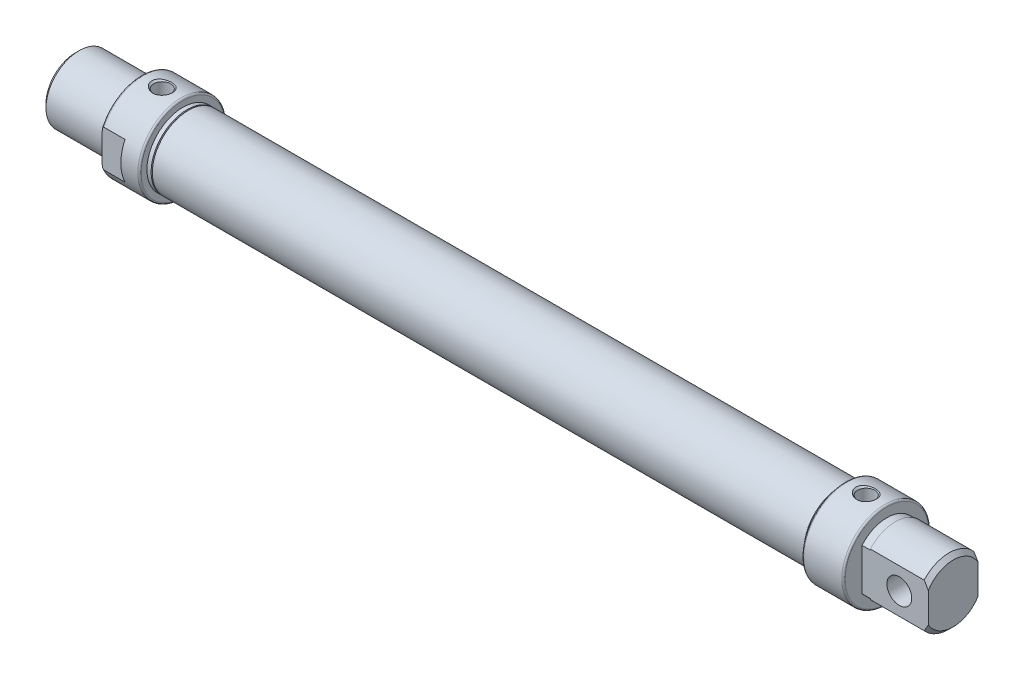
ISO-10303-21;
HEADER;
FILE_DESCRIPTION(('STEP AP214'),'2;1');
FILE_NAME('part.step','',(''),(''),'','','');
FILE_SCHEMA(('AUTOMOTIVE_DESIGN { 1 0 10303 214 1 1 1 1 }'));
ENDSEC;
DATA;
#1=APPLICATION_CONTEXT('core data for automotive mechanical design processes');
#2=APPLICATION_PROTOCOL_DEFINITION('international standard','automotive_design',2000,#1);
#3=PRODUCT_CONTEXT('',#1,'mechanical');
#4=PRODUCT('Part','Part','',(#3));
#5=PRODUCT_RELATED_PRODUCT_CATEGORY('part','',(#4));
#6=PRODUCT_DEFINITION_FORMATION('','',#4);
#7=PRODUCT_DEFINITION_CONTEXT('part definition',#1,'design');
#8=PRODUCT_DEFINITION('design','',#6,#7);
#9=PRODUCT_DEFINITION_SHAPE('','',#8);
#10=(LENGTH_UNIT() NAMED_UNIT(*) SI_UNIT(.MILLI.,.METRE.));
#11=(NAMED_UNIT(*) PLANE_ANGLE_UNIT() SI_UNIT($,.RADIAN.));
#12=(NAMED_UNIT(*) SI_UNIT($,.STERADIAN.) SOLID_ANGLE_UNIT());
#13=UNCERTAINTY_MEASURE_WITH_UNIT(LENGTH_MEASURE(1.E-05),#10,'distance_accuracy_value','');
#14=(GEOMETRIC_REPRESENTATION_CONTEXT(3) GLOBAL_UNCERTAINTY_ASSIGNED_CONTEXT((#13)) GLOBAL_UNIT_ASSIGNED_CONTEXT((#10,
#11,#12)) REPRESENTATION_CONTEXT('',''));
#15=CARTESIAN_POINT('',(0.,0.,0.));
#16=DIRECTION('',(0.,0.,1.));
#17=DIRECTION('',(1.,0.,0.));
#18=AXIS2_PLACEMENT_3D('',#15,#16,#17);
#19=CARTESIAN_POINT('',(196.,0.,0.));
#20=DIRECTION('',(-1.,0.,0.));
#21=DIRECTION('',(0.,0.,1.));
#22=AXIS2_PLACEMENT_3D('',#19,#20,#21);
#23=CYLINDRICAL_SURFACE('',#22,10.5);
#24=CARTESIAN_POINT('',(195.6,0.,0.));
#25=DIRECTION('',(-1.,0.,0.));
#26=DIRECTION('',(0.,0.,1.));
#27=AXIS2_PLACEMENT_3D('',#24,#25,#26);
#28=CIRCLE('',#27,10.5);
#29=CARTESIAN_POINT('',(195.6,0.,10.5));
#30=VERTEX_POINT('',#29);
#31=EDGE_CURVE('E180',#30,#30,#28,.T.);
#32=ORIENTED_EDGE('',*,*,#31,.T.);
#33=EDGE_LOOP('',(#32));
#34=FACE_BOUND('',#33,.T.);
#35=CARTESIAN_POINT('',(186.4,0.,0.));
#36=DIRECTION('',(-1.,0.,0.));
#37=DIRECTION('',(0.,0.,1.));
#38=AXIS2_PLACEMENT_3D('',#35,#36,#37);
#39=CIRCLE('',#38,10.5);
#40=CARTESIAN_POINT('',(186.4,0.,10.5));
#41=VERTEX_POINT('',#40);
#42=EDGE_CURVE('E183',#41,#41,#39,.T.);
#43=ORIENTED_EDGE('',*,*,#42,.F.);
#44=EDGE_LOOP('',(#43));
#45=FACE_BOUND('',#44,.T.);
#46=CARTESIAN_POINT('',(189.309460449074,10.3681992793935,-1.6584462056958));
#47=CARTESIAN_POINT('',(189.219654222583,10.3801184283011,-1.5839256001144));
#48=CARTESIAN_POINT('',(189.135225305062,10.3922449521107,-1.50297447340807));
#49=CARTESIAN_POINT('',(188.9793399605,10.4158892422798,-1.32925986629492));
#50=CARTESIAN_POINT('',(188.907885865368,10.4274068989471,-1.23649426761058));
#51=CARTESIAN_POINT('',(188.771957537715,10.4501643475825,-1.02783283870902));
#52=CARTESIAN_POINT('',(188.709623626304,10.4611701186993,-0.910498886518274));
#53=CARTESIAN_POINT('',(188.607892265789,10.4795728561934,-0.66597938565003));
#54=CARTESIAN_POINT('',(188.568484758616,10.4869714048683,-0.538798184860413));
#55=CARTESIAN_POINT('',(188.517751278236,10.496577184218,-0.292383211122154));
#56=CARTESIAN_POINT('',(188.503959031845,10.499239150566,-0.173672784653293));
#57=CARTESIAN_POINT('',(188.497521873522,10.5004760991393,0.0643135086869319));
#58=CARTESIAN_POINT('',(188.504867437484,10.4990529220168,0.183589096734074));
#59=CARTESIAN_POINT('',(188.539209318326,10.4925053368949,0.41183296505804));
#60=CARTESIAN_POINT('',(188.56500706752,10.4876068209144,0.520991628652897));
#61=CARTESIAN_POINT('',(188.633705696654,10.4748844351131,0.733584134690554));
#62=CARTESIAN_POINT('',(188.676608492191,10.4670602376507,0.837017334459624));
#63=CARTESIAN_POINT('',(188.779538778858,10.448949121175,1.03929967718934));
#64=CARTESIAN_POINT('',(188.840110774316,10.4385859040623,1.13786359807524));
#65=CARTESIAN_POINT('',(188.975489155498,10.4165532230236,1.32448731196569));
#66=CARTESIAN_POINT('',(189.050300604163,10.4048832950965,1.4125433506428));
#67=CARTESIAN_POINT('',(189.219809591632,10.3801083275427,1.58482061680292));
#68=CARTESIAN_POINT('',(189.315735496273,10.3669744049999,1.66782829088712));
#69=CARTESIAN_POINT('',(189.519174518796,10.3416406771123,1.81832451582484));
#70=CARTESIAN_POINT('',(189.626692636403,10.3294412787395,1.8858063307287));
#71=CARTESIAN_POINT('',(189.8619720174,10.305959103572,2.01038307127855));
#72=CARTESIAN_POINT('',(189.990680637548,10.2948942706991,2.06573401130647));
#73=CARTESIAN_POINT('',(190.255393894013,10.2764273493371,2.155726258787));
#74=CARTESIAN_POINT('',(190.391400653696,10.2690263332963,2.19036150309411));
#75=CARTESIAN_POINT('',(190.675528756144,10.2583548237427,2.23983343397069));
#76=CARTESIAN_POINT('',(190.823888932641,10.2553568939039,2.25336664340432));
#77=CARTESIAN_POINT('',(191.120871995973,10.2547000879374,2.25635204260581));
#78=CARTESIAN_POINT('',(191.269494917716,10.2570419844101,2.24580074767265));
#79=CARTESIAN_POINT('',(191.565340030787,10.2668740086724,2.20041926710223));
#80=CARTESIAN_POINT('',(191.712498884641,10.2744482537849,2.16519225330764));
#81=CARTESIAN_POINT('',(191.998597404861,10.2939217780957,2.07062575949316));
#82=CARTESIAN_POINT('',(192.137536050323,10.3058215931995,2.01128329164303));
#83=CARTESIAN_POINT('',(192.401127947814,10.3323114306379,1.87040017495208));
#84=CARTESIAN_POINT('',(192.525940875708,10.3468651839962,1.78915247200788));
#85=CARTESIAN_POINT('',(192.75890099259,10.3769350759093,1.60556442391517));
#86=CARTESIAN_POINT('',(192.86705225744,10.3924509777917,1.50322925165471));
#87=CARTESIAN_POINT('',(193.056038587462,10.421420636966,1.28653750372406));
#88=CARTESIAN_POINT('',(193.138139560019,10.4349424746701,1.17329858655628));
#89=CARTESIAN_POINT('',(193.279477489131,10.4591519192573,0.933077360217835));
#90=CARTESIAN_POINT('',(193.338737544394,10.4698423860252,0.806109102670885));
#91=CARTESIAN_POINT('',(193.425737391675,10.4858551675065,0.557325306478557));
#92=CARTESIAN_POINT('',(193.456251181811,10.4916425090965,0.436508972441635));
#93=CARTESIAN_POINT('',(193.494727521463,10.4989731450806,0.19122864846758));
#94=CARTESIAN_POINT('',(193.502704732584,10.5005191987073,0.0667670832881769));
#95=CARTESIAN_POINT('',(193.495979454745,10.4992277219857,-0.170417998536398));
#96=CARTESIAN_POINT('',(193.483224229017,10.496766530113,-0.283204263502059));
#97=CARTESIAN_POINT('',(193.439278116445,10.4884371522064,-0.504974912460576));
#98=CARTESIAN_POINT('',(193.408087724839,10.4825690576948,-0.613959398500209));
#99=CARTESIAN_POINT('',(193.328633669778,10.4680396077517,-0.82548377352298));
#100=CARTESIAN_POINT('',(193.280340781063,10.4593734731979,-0.928012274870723));
#101=CARTESIAN_POINT('',(193.16861442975,10.4401071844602,-1.12423241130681));
#102=CARTESIAN_POINT('',(193.105176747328,10.4295064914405,-1.21792157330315));
#103=CARTESIAN_POINT('',(192.959536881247,10.406417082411,-1.40206763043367));
#104=CARTESIAN_POINT('',(192.87622492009,10.3938448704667,-1.49163473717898));
#105=CARTESIAN_POINT('',(192.696986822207,10.3687536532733,-1.65709557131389));
#106=CARTESIAN_POINT('',(192.601055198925,10.3562346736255,-1.73298331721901));
#107=CARTESIAN_POINT('',(192.388304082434,10.3310850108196,-1.87739926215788));
#108=CARTESIAN_POINT('',(192.270348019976,10.3185849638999,-1.94427796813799));
#109=CARTESIAN_POINT('',(192.025317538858,10.2962888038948,-2.05909305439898));
#110=CARTESIAN_POINT('',(191.898239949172,10.2864936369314,-2.10702280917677));
#111=CARTESIAN_POINT('',(191.62806319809,10.2699689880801,-2.18621099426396));
#112=CARTESIAN_POINT('',(191.48448398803,10.2635338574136,-2.21590041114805));
#113=CARTESIAN_POINT('',(191.194284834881,10.2556659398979,-2.25203420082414));
#114=CARTESIAN_POINT('',(191.04766423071,10.2542342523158,-2.25847346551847));
#115=CARTESIAN_POINT('',(190.750960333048,10.2565717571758,-2.24783735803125));
#116=CARTESIAN_POINT('',(190.6009028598,10.260496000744,-2.23006098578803));
#117=CARTESIAN_POINT('',(190.305964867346,10.2733569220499,-2.17003948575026));
#118=CARTESIAN_POINT('',(190.161084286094,10.2822935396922,-2.12779465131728));
#119=CARTESIAN_POINT('',(189.89205577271,10.3032168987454,-2.02392589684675));
#120=CARTESIAN_POINT('',(189.767176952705,10.314901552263,-1.96412782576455));
#121=CARTESIAN_POINT('',(189.528863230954,10.3403621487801,-1.82534198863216));
#122=CARTESIAN_POINT('',(189.415419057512,10.3541363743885,-1.74636994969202));
#123=CARTESIAN_POINT('',(189.309460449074,10.3681992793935,-1.6584462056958));
#124=B_SPLINE_CURVE_WITH_KNOTS('',3,(#46,#47,#48,#49,#50,#51,#52,#53,#54,#55,#56,#57,#58,#59,
#60,#61,#62,#63,#64,#65,#66,#67,#68,#69,#70,#71,#72,#73,#74,#75,#76,#77,#78,#79,#80,#81,#82,#83,
#84,#85,#86,#87,#88,#89,#90,#91,#92,#93,#94,#95,#96,#97,#98,#99,#100,#101,#102,#103,#104,#105,
#106,#107,#108,#109,#110,#111,#112,#113,#114,#115,#116,#117,#118,#119,#120,#121,#122,#123),
.UNSPECIFIED.,.T.,.F.,(4,2,2,2,2,2,2,2,2,2,2,2,2,2,2,2,2,2,2,2,2,2,2,2,2,2,2,2,2,2,2,2,2,2,2,2,
2,2,4),(0.,0.3515624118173,0.703187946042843,1.10087280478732,1.49838306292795,1.85510993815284,
2.21167610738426,2.54696852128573,2.8822984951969,3.22931033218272,3.57644578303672,
3.95746949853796,4.33865821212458,4.75845050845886,5.17836561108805,5.62331560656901,
6.06832998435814,6.52067034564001,6.97306676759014,7.41968994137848,7.86620368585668,
8.28541519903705,8.70420164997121,9.0763797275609,9.448315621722,9.78728990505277,
10.1262550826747,10.4658023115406,10.8054442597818,11.1728413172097,11.5403986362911,
11.9471783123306,12.3541000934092,12.7923742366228,13.2307446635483,13.6820784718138,
14.1334068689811,14.548540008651,14.9633337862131),.UNSPECIFIED.);
#125=CARTESIAN_POINT('',(189.309460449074,10.3681992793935,-1.6584462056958));
#126=VERTEX_POINT('',#125);
#127=EDGE_CURVE('E11',#126,#126,#124,.T.);
#128=ORIENTED_EDGE('',*,*,#127,.F.);
#129=EDGE_LOOP('',(#128));
#130=FACE_BOUND('',#129,.T.);
#131=ADVANCED_FACE('F16',(#34,#45,#130),#23,.T.);
#132=CARTESIAN_POINT('',(196.,0.,0.));
#133=DIRECTION('',(-1.,0.,0.));
#134=DIRECTION('',(0.,0.,1.));
#135=AXIS2_PLACEMENT_3D('',#132,#133,#134);
#136=CYLINDRICAL_SURFACE('',#135,10.5);
#137=CARTESIAN_POINT('',(25.6,0.,0.));
#138=DIRECTION('',(-1.,0.,0.));
#139=DIRECTION('',(0.,0.,1.));
#140=AXIS2_PLACEMENT_3D('',#137,#138,#139);
#141=CIRCLE('',#140,10.5);
#142=CARTESIAN_POINT('',(25.6,0.,10.5));
#143=VERTEX_POINT('',#142);
#144=EDGE_CURVE('E216',#143,#143,#141,.T.);
#145=ORIENTED_EDGE('',*,*,#144,.T.);
#146=EDGE_LOOP('',(#145));
#147=FACE_BOUND('',#146,.T.);
#148=DIRECTION('',(-1.,0.,0.));
#149=VECTOR('',#148,1.);
#150=CARTESIAN_POINT('',(196.,-4.47213595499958,9.5));
#151=LINE('',#150,#149);
#152=CARTESIAN_POINT('',(21.5,-4.47213595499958,9.5));
#153=VERTEX_POINT('',#152);
#154=CARTESIAN_POINT('',(16.4,-4.47213595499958,9.5));
#155=VERTEX_POINT('',#154);
#156=EDGE_CURVE('E143',#153,#155,#151,.T.);
#157=ORIENTED_EDGE('',*,*,#156,.T.);
#158=CARTESIAN_POINT('',(16.4,0.,0.));
#159=DIRECTION('',(-1.,0.,0.));
#160=DIRECTION('',(0.,0.,1.));
#161=AXIS2_PLACEMENT_3D('',#158,#159,#160);
#162=CIRCLE('',#161,10.5);
#163=CARTESIAN_POINT('',(16.4,-4.47213595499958,-9.5));
#164=VERTEX_POINT('',#163);
#165=EDGE_CURVE('E219',#164,#155,#162,.T.);
#166=ORIENTED_EDGE('',*,*,#165,.F.);
#167=DIRECTION('',(-1.,0.,0.));
#168=VECTOR('',#167,1.);
#169=CARTESIAN_POINT('',(196.,-4.47213595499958,-9.5));
#170=LINE('',#169,#168);
#171=CARTESIAN_POINT('',(21.5,-4.47213595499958,-9.5));
#172=VERTEX_POINT('',#171);
#173=EDGE_CURVE('E239',#164,#172,#170,.F.);
#174=ORIENTED_EDGE('',*,*,#173,.T.);
#175=CARTESIAN_POINT('',(21.5,0.,0.));
#176=DIRECTION('',(1.,0.,0.));
#177=DIRECTION('',(0.,0.,-1.));
#178=AXIS2_PLACEMENT_3D('',#175,#176,#177);
#179=CIRCLE('',#178,10.5);
#180=CARTESIAN_POINT('',(21.5,4.47213595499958,-9.5));
#181=VERTEX_POINT('',#180);
#182=EDGE_CURVE('E242',#172,#181,#179,.T.);
#183=ORIENTED_EDGE('',*,*,#182,.T.);
#184=DIRECTION('',(-1.,0.,0.));
#185=VECTOR('',#184,1.);
#186=CARTESIAN_POINT('',(196.,4.47213595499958,-9.5));
#187=LINE('',#186,#185);
#188=CARTESIAN_POINT('',(16.4,4.47213595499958,-9.5));
#189=VERTEX_POINT('',#188);
#190=EDGE_CURVE('E245',#181,#189,#187,.T.);
#191=ORIENTED_EDGE('',*,*,#190,.T.);
#192=CARTESIAN_POINT('',(16.4,4.47213595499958,9.5));
#193=VERTEX_POINT('',#192);
#194=EDGE_CURVE('E220',#193,#189,#162,.T.);
#195=ORIENTED_EDGE('',*,*,#194,.F.);
#196=DIRECTION('',(-1.,0.,0.));
#197=VECTOR('',#196,1.);
#198=CARTESIAN_POINT('',(196.,4.47213595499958,9.5));
#199=LINE('',#198,#197);
#200=CARTESIAN_POINT('',(21.5,4.47213595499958,9.5));
#201=VERTEX_POINT('',#200);
#202=EDGE_CURVE('E249',#193,#201,#199,.F.);
#203=ORIENTED_EDGE('',*,*,#202,.T.);
#204=EDGE_CURVE('E246',#201,#153,#179,.T.);
#205=ORIENTED_EDGE('',*,*,#204,.T.);
#206=EDGE_LOOP('',(#157,#166,#174,#183,#191,#195,#203,#205));
#207=FACE_BOUND('',#206,.T.);
#208=CARTESIAN_POINT('',(19.3094604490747,10.3681992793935,-1.65844620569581));
#209=CARTESIAN_POINT('',(19.2196542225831,10.3801184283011,-1.58392560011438));
#210=CARTESIAN_POINT('',(19.1352253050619,10.3922449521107,-1.50297447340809));
#211=CARTESIAN_POINT('',(18.9793399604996,10.4158892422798,-1.32925986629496));
#212=CARTESIAN_POINT('',(18.907885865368,10.4274068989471,-1.23649426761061));
#213=CARTESIAN_POINT('',(18.7719575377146,10.4501643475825,-1.02783283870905));
#214=CARTESIAN_POINT('',(18.7096236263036,10.4611701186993,-0.910498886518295));
#215=CARTESIAN_POINT('',(18.6078922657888,10.4795728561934,-0.665979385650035));
#216=CARTESIAN_POINT('',(18.5684847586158,10.4869714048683,-0.538798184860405));
#217=CARTESIAN_POINT('',(18.5177512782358,10.496577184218,-0.292383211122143));
#218=CARTESIAN_POINT('',(18.5039590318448,10.499239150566,-0.173672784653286));
#219=CARTESIAN_POINT('',(18.4975218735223,10.5004760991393,0.0643135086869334));
#220=CARTESIAN_POINT('',(18.504867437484,10.4990529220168,0.183589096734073));
#221=CARTESIAN_POINT('',(18.5392093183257,10.4925053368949,0.411832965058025));
#222=CARTESIAN_POINT('',(18.5650070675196,10.4876068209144,0.52099162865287));
#223=CARTESIAN_POINT('',(18.6337056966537,10.4748844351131,0.733584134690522));
#224=CARTESIAN_POINT('',(18.6766084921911,10.4670602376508,0.837017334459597));
#225=CARTESIAN_POINT('',(18.7795387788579,10.448949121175,1.0392996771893));
#226=CARTESIAN_POINT('',(18.8401107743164,10.4385859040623,1.1378635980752));
#227=CARTESIAN_POINT('',(18.975489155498,10.4165532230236,1.32448731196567));
#228=CARTESIAN_POINT('',(19.0503006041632,10.4048832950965,1.41254335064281));
#229=CARTESIAN_POINT('',(19.2198095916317,10.3801083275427,1.58482061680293));
#230=CARTESIAN_POINT('',(19.315735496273,10.3669744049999,1.66782829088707));
#231=CARTESIAN_POINT('',(19.5191745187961,10.3416406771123,1.81832451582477));
#232=CARTESIAN_POINT('',(19.6266926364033,10.3294412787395,1.88580633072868));
#233=CARTESIAN_POINT('',(19.8619720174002,10.305959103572,2.01038307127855));
#234=CARTESIAN_POINT('',(19.9906806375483,10.2948942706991,2.06573401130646));
#235=CARTESIAN_POINT('',(20.2553938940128,10.2764273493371,2.15572625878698));
#236=CARTESIAN_POINT('',(20.3914006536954,10.2690263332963,2.1903615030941));
#237=CARTESIAN_POINT('',(20.6755287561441,10.2583548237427,2.23983343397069));
#238=CARTESIAN_POINT('',(20.8238889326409,10.2553568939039,2.25336664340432));
#239=CARTESIAN_POINT('',(21.1208719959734,10.2547000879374,2.25635204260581));
#240=CARTESIAN_POINT('',(21.2694949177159,10.2570419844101,2.24580074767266));
#241=CARTESIAN_POINT('',(21.5653400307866,10.2668740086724,2.20041926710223));
#242=CARTESIAN_POINT('',(21.7124988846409,10.2744482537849,2.16519225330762));
#243=CARTESIAN_POINT('',(21.9985974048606,10.2939217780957,2.07062575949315));
#244=CARTESIAN_POINT('',(22.137536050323,10.3058215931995,2.01128329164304));
#245=CARTESIAN_POINT('',(22.4011279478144,10.3323114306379,1.87040017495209));
#246=CARTESIAN_POINT('',(22.5259408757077,10.3468651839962,1.78915247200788));
#247=CARTESIAN_POINT('',(22.7589009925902,10.3769350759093,1.60556442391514));
#248=CARTESIAN_POINT('',(22.8670522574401,10.3924509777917,1.50322925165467));
#249=CARTESIAN_POINT('',(23.0560385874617,10.421420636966,1.28653750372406));
#250=CARTESIAN_POINT('',(23.1381395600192,10.4349424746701,1.17329858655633));
#251=CARTESIAN_POINT('',(23.2794774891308,10.4591519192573,0.9330773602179));
#252=CARTESIAN_POINT('',(23.3387375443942,10.4698423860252,0.806109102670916));
#253=CARTESIAN_POINT('',(23.4257373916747,10.4858551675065,0.557325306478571));
#254=CARTESIAN_POINT('',(23.456251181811,10.4916425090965,0.436508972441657));
#255=CARTESIAN_POINT('',(23.494727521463,10.4989731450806,0.191228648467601));
#256=CARTESIAN_POINT('',(23.5027047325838,10.5005191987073,0.0667670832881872));
#257=CARTESIAN_POINT('',(23.4959794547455,10.4992277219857,-0.170417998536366));
#258=CARTESIAN_POINT('',(23.4832242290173,10.496766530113,-0.283204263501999));
#259=CARTESIAN_POINT('',(23.4392781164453,10.4884371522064,-0.504974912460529));
#260=CARTESIAN_POINT('',(23.4080877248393,10.4825690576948,-0.613959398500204));
#261=CARTESIAN_POINT('',(23.3286336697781,10.4680396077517,-0.825483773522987));
#262=CARTESIAN_POINT('',(23.2803407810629,10.4593734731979,-0.928012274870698));
#263=CARTESIAN_POINT('',(23.16861442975,10.4401071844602,-1.12423241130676));
#264=CARTESIAN_POINT('',(23.1051767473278,10.4295064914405,-1.21792157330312));
#265=CARTESIAN_POINT('',(22.9595368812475,10.406417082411,-1.40206763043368));
#266=CARTESIAN_POINT('',(22.8762249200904,10.3938448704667,-1.49163473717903));
#267=CARTESIAN_POINT('',(22.6969868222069,10.3687536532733,-1.65709557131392));
#268=CARTESIAN_POINT('',(22.6010551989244,10.3562346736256,-1.73298331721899));
#269=CARTESIAN_POINT('',(22.3883040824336,10.3310850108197,-1.87739926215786));
#270=CARTESIAN_POINT('',(22.2703480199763,10.3185849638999,-1.94427796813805));
#271=CARTESIAN_POINT('',(22.0253175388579,10.2962888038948,-2.05909305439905));
#272=CARTESIAN_POINT('',(21.8982399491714,10.2864936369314,-2.10702280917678));
#273=CARTESIAN_POINT('',(21.6280631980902,10.2699689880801,-2.18621099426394));
#274=CARTESIAN_POINT('',(21.4844839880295,10.2635338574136,-2.21590041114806));
#275=CARTESIAN_POINT('',(21.1942848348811,10.2556659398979,-2.25203420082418));
#276=CARTESIAN_POINT('',(21.0476642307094,10.2542342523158,-2.25847346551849));
#277=CARTESIAN_POINT('',(20.7509603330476,10.2565717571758,-2.24783735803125));
#278=CARTESIAN_POINT('',(20.6009028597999,10.260496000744,-2.23006098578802));
#279=CARTESIAN_POINT('',(20.3059648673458,10.2733569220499,-2.17003948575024));
#280=CARTESIAN_POINT('',(20.1610842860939,10.2822935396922,-2.12779465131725));
#281=CARTESIAN_POINT('',(19.8920557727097,10.3032168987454,-2.02392589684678));
#282=CARTESIAN_POINT('',(19.7671769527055,10.314901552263,-1.96412782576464));
#283=CARTESIAN_POINT('',(19.5288632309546,10.3403621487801,-1.82534198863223));
#284=CARTESIAN_POINT('',(19.4154190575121,10.3541363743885,-1.74636994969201));
#285=CARTESIAN_POINT('',(19.3094604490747,10.3681992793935,-1.65844620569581));
#286=B_SPLINE_CURVE_WITH_KNOTS('',3,(#208,#209,#210,#211,#212,#213,#214,#215,#216,#217,#218,
#219,#220,#221,#222,#223,#224,#225,#226,#227,#228,#229,#230,#231,#232,#233,#234,#235,#236,#237,
#238,#239,#240,#241,#242,#243,#244,#245,#246,#247,#248,#249,#250,#251,#252,#253,#254,#255,#256,
#257,#258,#259,#260,#261,#262,#263,#264,#265,#266,#267,#268,#269,#270,#271,#272,#273,#274,#275,
#276,#277,#278,#279,#280,#281,#282,#283,#284,#285),.UNSPECIFIED.,.T.,.F.,(4,2,2,2,2,2,2,2,2,2,2,
2,2,2,2,2,2,2,2,2,2,2,2,2,2,2,2,2,2,2,2,2,2,2,2,2,2,2,4),(0.,0.351562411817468,
0.703187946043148,1.10087280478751,1.49838306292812,1.85510993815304,2.21167610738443,
2.5469685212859,2.88229849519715,3.22931033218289,3.57644578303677,3.95746949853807,
4.33865821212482,4.75845050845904,5.17836561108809,5.62331560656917,6.06832998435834,
6.5206703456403,6.97306676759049,7.41968994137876,7.86620368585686,8.28541519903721,
8.70420164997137,9.07637972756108,9.44831562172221,9.78728990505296,10.1262550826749,
10.4658023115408,10.8054442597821,11.17284131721,11.5403986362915,11.9471783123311,
12.3541000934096,12.7923742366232,13.2307446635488,13.6820784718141,14.1334068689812,
14.5485400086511,14.9633337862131),.UNSPECIFIED.);
#287=CARTESIAN_POINT('',(19.3094604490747,10.3681992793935,-1.65844620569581));
#288=VERTEX_POINT('',#287);
#289=EDGE_CURVE('E29',#288,#288,#286,.T.);
#290=ORIENTED_EDGE('',*,*,#289,.F.);
#291=EDGE_LOOP('',(#290));
#292=FACE_BOUND('',#291,.T.);
#293=ADVANCED_FACE('F260',(#147,#207,#292),#136,.T.);
#294=CARTESIAN_POINT('',(212.,0.,0.));
#295=DIRECTION('',(-1.,0.,0.));
#296=DIRECTION('',(0.,0.,1.));
#297=AXIS2_PLACEMENT_3D('',#294,#295,#296);
#298=CYLINDRICAL_SURFACE('',#297,7.85);
#299=DIRECTION('',(-1.,0.,0.));
#300=VECTOR('',#299,1.);
#301=CARTESIAN_POINT('',(212.,5.06186724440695,6.));
#302=LINE('',#301,#300);
#303=CARTESIAN_POINT('',(198.,5.06186724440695,6.));
#304=VERTEX_POINT('',#303);
#305=CARTESIAN_POINT('',(196.,5.06186724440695,6.));
#306=VERTEX_POINT('',#305);
#307=EDGE_CURVE('E316',#304,#306,#302,.T.);
#308=ORIENTED_EDGE('',*,*,#307,.F.);
#309=CARTESIAN_POINT('',(198.,0.,0.));
#310=DIRECTION('',(-1.,0.,0.));
#311=DIRECTION('',(0.,0.,1.));
#312=AXIS2_PLACEMENT_3D('',#309,#310,#311);
#313=CIRCLE('',#312,7.85);
#314=CARTESIAN_POINT('',(198.,5.06186724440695,-6.));
#315=VERTEX_POINT('',#314);
#316=EDGE_CURVE('E174',#304,#315,#313,.T.);
#317=ORIENTED_EDGE('',*,*,#316,.T.);
#318=DIRECTION('',(-1.,0.,0.));
#319=VECTOR('',#318,1.);
#320=CARTESIAN_POINT('',(212.,5.06186724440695,-6.));
#321=LINE('',#320,#319);
#322=CARTESIAN_POINT('',(196.,5.06186724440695,-6.));
#323=VERTEX_POINT('',#322);
#324=EDGE_CURVE('E311',#323,#315,#321,.F.);
#325=ORIENTED_EDGE('',*,*,#324,.F.);
#326=CARTESIAN_POINT('',(196.,0.,0.));
#327=DIRECTION('',(-1.,0.,0.));
#328=DIRECTION('',(0.,0.,1.));
#329=AXIS2_PLACEMENT_3D('',#326,#327,#328);
#330=CIRCLE('',#329,7.85);
#331=EDGE_CURVE('E235',#323,#306,#330,.F.);
#332=ORIENTED_EDGE('',*,*,#331,.T.);
#333=EDGE_LOOP('',(#308,#317,#325,#332));
#334=FACE_BOUND('',#333,.T.);
#335=ADVANCED_FACE('F396',(#334),#298,.T.);
#336=DIRECTION('',(-1.,0.,0.));
#337=VECTOR('',#336,1.);
#338=CARTESIAN_POINT('',(212.,-5.06186724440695,6.));
#339=LINE('',#338,#337);
#340=CARTESIAN_POINT('',(196.,-5.06186724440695,6.));
#341=VERTEX_POINT('',#340);
#342=CARTESIAN_POINT('',(198.,-5.06186724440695,6.));
#343=VERTEX_POINT('',#342);
#344=EDGE_CURVE('E321',#341,#343,#339,.F.);
#345=ORIENTED_EDGE('',*,*,#344,.F.);
#346=CARTESIAN_POINT('',(196.,-5.06186724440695,-6.));
#347=VERTEX_POINT('',#346);
#348=EDGE_CURVE('E236',#341,#347,#330,.F.);
#349=ORIENTED_EDGE('',*,*,#348,.T.);
#350=DIRECTION('',(-1.,0.,0.));
#351=VECTOR('',#350,1.);
#352=CARTESIAN_POINT('',(212.,-5.06186724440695,-6.));
#353=LINE('',#352,#351);
#354=CARTESIAN_POINT('',(198.,-5.06186724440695,-6.));
#355=VERTEX_POINT('',#354);
#356=EDGE_CURVE('E555',#355,#347,#353,.T.);
#357=ORIENTED_EDGE('',*,*,#356,.F.);
#358=EDGE_CURVE('E173',#355,#343,#313,.T.);
#359=ORIENTED_EDGE('',*,*,#358,.T.);
#360=EDGE_LOOP('',(#345,#349,#357,#359));
#361=FACE_BOUND('',#360,.T.);
#362=ADVANCED_FACE('F566',(#361),#298,.T.);
#363=CARTESIAN_POINT('',(198.,7.85,0.));
#364=DIRECTION('',(1.,0.,0.));
#365=DIRECTION('',(0.,0.,-1.));
#366=AXIS2_PLACEMENT_3D('',#363,#364,#365);
#367=PLANE('',#366);
#368=DIRECTION('',(0.,-1.,0.));
#369=VECTOR('',#368,1.);
#370=CARTESIAN_POINT('',(198.,7.85,6.));
#371=LINE('',#370,#369);
#372=CARTESIAN_POINT('',(198.,5.29150262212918,6.));
#373=VERTEX_POINT('',#372);
#374=EDGE_CURVE('E314',#373,#304,#371,.T.);
#375=ORIENTED_EDGE('',*,*,#374,.F.);
#376=CARTESIAN_POINT('',(198.,0.,0.));
#377=DIRECTION('',(-1.,0.,0.));
#378=DIRECTION('',(0.,0.,1.));
#379=AXIS2_PLACEMENT_3D('',#376,#377,#378);
#380=CIRCLE('',#379,8.);
#381=CARTESIAN_POINT('',(198.,5.29150262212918,-6.));
#382=VERTEX_POINT('',#381);
#383=EDGE_CURVE('E171',#373,#382,#380,.T.);
#384=ORIENTED_EDGE('',*,*,#383,.T.);
#385=DIRECTION('',(0.,1.,0.));
#386=VECTOR('',#385,1.);
#387=CARTESIAN_POINT('',(198.,7.85,-6.));
#388=LINE('',#387,#386);
#389=EDGE_CURVE('E563',#315,#382,#388,.T.);
#390=ORIENTED_EDGE('',*,*,#389,.F.);
#391=ORIENTED_EDGE('',*,*,#316,.F.);
#392=EDGE_LOOP('',(#375,#384,#390,#391));
#393=FACE_BOUND('',#392,.T.);
#394=ADVANCED_FACE('F589',(#393),#367,.F.);
#395=CARTESIAN_POINT('',(198.,-5.29150262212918,6.));
#396=VERTEX_POINT('',#395);
#397=EDGE_CURVE('E317',#343,#396,#371,.T.);
#398=ORIENTED_EDGE('',*,*,#397,.F.);
#399=ORIENTED_EDGE('',*,*,#358,.F.);
#400=CARTESIAN_POINT('',(198.,-5.29150262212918,-6.));
#401=VERTEX_POINT('',#400);
#402=EDGE_CURVE('E576',#401,#355,#388,.T.);
#403=ORIENTED_EDGE('',*,*,#402,.F.);
#404=EDGE_CURVE('E170',#401,#396,#380,.T.);
#405=ORIENTED_EDGE('',*,*,#404,.T.);
#406=EDGE_LOOP('',(#398,#399,#403,#405));
#407=FACE_BOUND('',#406,.T.);
#408=ADVANCED_FACE('F573',(#407),#367,.F.);
#409=CARTESIAN_POINT('',(212.,0.,0.));
#410=DIRECTION('',(-1.,0.,0.));
#411=DIRECTION('',(0.,0.,1.));
#412=AXIS2_PLACEMENT_3D('',#409,#410,#411);
#413=CYLINDRICAL_SURFACE('',#412,8.);
#414=DIRECTION('',(-1.,0.,0.));
#415=VECTOR('',#414,1.);
#416=CARTESIAN_POINT('',(212.,5.29150262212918,-6.));
#417=LINE('',#416,#415);
#418=CARTESIAN_POINT('',(211.,5.29150262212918,-6.));
#419=VERTEX_POINT('',#418);
#420=EDGE_CURVE('E579',#382,#419,#417,.F.);
#421=ORIENTED_EDGE('',*,*,#420,.F.);
#422=ORIENTED_EDGE('',*,*,#383,.F.);
#423=DIRECTION('',(-1.,0.,0.));
#424=VECTOR('',#423,1.);
#425=CARTESIAN_POINT('',(212.,5.29150262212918,6.));
#426=LINE('',#425,#424);
#427=CARTESIAN_POINT('',(211.,5.29150262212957,6.));
#428=VERTEX_POINT('',#427);
#429=EDGE_CURVE('E310',#428,#373,#426,.T.);
#430=ORIENTED_EDGE('',*,*,#429,.F.);
#431=CARTESIAN_POINT('',(211.,0.,0.));
#432=DIRECTION('',(-1.,0.,0.));
#433=DIRECTION('',(0.,0.,1.));
#434=AXIS2_PLACEMENT_3D('',#431,#432,#433);
#435=CIRCLE('',#434,8.);
#436=EDGE_CURVE('E168',#428,#419,#435,.T.);
#437=ORIENTED_EDGE('',*,*,#436,.T.);
#438=EDGE_LOOP('',(#421,#422,#430,#437));
#439=FACE_BOUND('',#438,.T.);
#440=ADVANCED_FACE('F299',(#439),#413,.T.);
#441=DIRECTION('',(-1.,0.,0.));
#442=VECTOR('',#441,1.);
#443=CARTESIAN_POINT('',(212.,-5.29150262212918,-6.));
#444=LINE('',#443,#442);
#445=CARTESIAN_POINT('',(211.,-5.29150262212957,-6.));
#446=VERTEX_POINT('',#445);
#447=EDGE_CURVE('E151',#446,#401,#444,.T.);
#448=ORIENTED_EDGE('',*,*,#447,.F.);
#449=CARTESIAN_POINT('',(211.,-5.29150262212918,6.));
#450=VERTEX_POINT('',#449);
#451=EDGE_CURVE('E150',#446,#450,#435,.T.);
#452=ORIENTED_EDGE('',*,*,#451,.T.);
#453=DIRECTION('',(-1.,0.,0.));
#454=VECTOR('',#453,1.);
#455=CARTESIAN_POINT('',(212.,-5.29150262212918,6.));
#456=LINE('',#455,#454);
#457=EDGE_CURVE('E319',#396,#450,#456,.F.);
#458=ORIENTED_EDGE('',*,*,#457,.F.);
#459=ORIENTED_EDGE('',*,*,#404,.F.);
#460=EDGE_LOOP('',(#448,#452,#458,#459));
#461=FACE_BOUND('',#460,.T.);
#462=ADVANCED_FACE('F297',(#461),#413,.T.);
#463=CARTESIAN_POINT('',(212.,0.,0.));
#464=DIRECTION('',(-1.,0.,0.));
#465=DIRECTION('',(0.,0.,1.));
#466=AXIS2_PLACEMENT_3D('',#463,#464,#465);
#467=CONICAL_SURFACE('',#466,7.,0.785398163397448);
#468=CARTESIAN_POINT('',(201.381068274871,-16.5658309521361,6.));
#469=CARTESIAN_POINT('',(201.626240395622,-16.3050678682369,6.));
#470=CARTESIAN_POINT('',(201.871061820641,-16.0439747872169,6.));
#471=CARTESIAN_POINT('',(202.359885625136,-15.521020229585,6.));
#472=CARTESIAN_POINT('',(202.603887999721,-15.2591587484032,6.));
#473=CARTESIAN_POINT('',(203.334832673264,-14.4718900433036,6.));
#474=CARTESIAN_POINT('',(203.820362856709,-13.9451697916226,6.));
#475=CARTESIAN_POINT('',(204.798763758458,-12.8734014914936,6.));
#476=CARTESIAN_POINT('',(205.291500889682,-12.3282310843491,6.));
#477=CARTESIAN_POINT('',(206.024632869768,-11.5054542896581,6.));
#478=CARTESIAN_POINT('',(206.267940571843,-11.2304439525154,6.));
#479=CARTESIAN_POINT('',(206.752174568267,-10.6783361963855,6.));
#480=CARTESIAN_POINT('',(206.99310088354,-10.4012387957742,6.));
#481=CARTESIAN_POINT('',(207.471881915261,-9.84467522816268,6.));
#482=CARTESIAN_POINT('',(207.709738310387,-9.56521050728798,6.));
#483=CARTESIAN_POINT('',(208.18177925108,-9.00317649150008,6.));
#484=CARTESIAN_POINT('',(208.415963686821,-8.72060710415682,6.));
#485=CARTESIAN_POINT('',(208.880103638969,-8.15105044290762,6.));
#486=CARTESIAN_POINT('',(209.11004959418,-7.86405535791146,6.));
#487=CARTESIAN_POINT('',(209.563768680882,-7.28524495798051,6.));
#488=CARTESIAN_POINT('',(209.787542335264,-6.99343005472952,6.));
#489=CARTESIAN_POINT('',(210.224538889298,-6.40676493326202,6.));
#490=CARTESIAN_POINT('',(210.437848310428,-6.11197940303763,6.));
#491=CARTESIAN_POINT('',(210.853580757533,-5.51455674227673,6.));
#492=CARTESIAN_POINT('',(211.055999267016,-5.21191643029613,6.));
#493=CARTESIAN_POINT('',(211.347627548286,-4.75108222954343,6.));
#494=CARTESIAN_POINT('',(211.442687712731,-4.59658988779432,6.));
#495=CARTESIAN_POINT('',(211.62815165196,-4.28484227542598,6.));
#496=CARTESIAN_POINT('',(211.718555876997,-4.12758727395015,6.));
#497=CARTESIAN_POINT('',(211.893704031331,-3.81011169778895,6.));
#498=CARTESIAN_POINT('',(211.978452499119,-3.64989363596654,6.));
#499=CARTESIAN_POINT('',(212.141194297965,-3.32607977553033,6.));
#500=CARTESIAN_POINT('',(212.219189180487,-3.16248476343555,6.));
#501=CARTESIAN_POINT('',(212.33391761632,-2.90573934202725,6.));
#502=CARTESIAN_POINT('',(212.373486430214,-2.81385309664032,6.));
#503=CARTESIAN_POINT('',(212.449866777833,-2.62894220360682,6.));
#504=CARTESIAN_POINT('',(212.486678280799,-2.53591754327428,6.));
#505=CARTESIAN_POINT('',(212.592559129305,-2.25507646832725,6.));
#506=CARTESIAN_POINT('',(212.657070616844,-2.06550222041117,6.));
#507=CARTESIAN_POINT('',(212.771079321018,-1.68301954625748,6.));
#508=CARTESIAN_POINT('',(212.820659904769,-1.49013623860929,6.));
#509=CARTESIAN_POINT('',(212.902831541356,-1.10074436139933,6.));
#510=CARTESIAN_POINT('',(212.935424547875,-0.904236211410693,6.));
#511=CARTESIAN_POINT('',(212.981960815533,-0.506289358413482,6.));
#512=CARTESIAN_POINT('',(212.995646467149,-0.304819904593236,6.));
#513=CARTESIAN_POINT('',(213.002579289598,0.0984586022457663,6.));
#514=CARTESIAN_POINT('',(212.995828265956,0.300267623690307,6.));
#515=CARTESIAN_POINT('',(212.962314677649,0.702888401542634,6.));
#516=CARTESIAN_POINT('',(212.935483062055,0.903694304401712,6.));
#517=CARTESIAN_POINT('',(212.863491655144,1.30198427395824,6.));
#518=CARTESIAN_POINT('',(212.818326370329,1.49946732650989,6.));
#519=CARTESIAN_POINT('',(212.69299462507,1.96054877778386,6.));
#520=CARTESIAN_POINT('',(212.606079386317,2.22229963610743,6.));
#521=CARTESIAN_POINT('',(212.409495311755,2.73706530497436,6.));
#522=CARTESIAN_POINT('',(212.299813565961,2.99007506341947,6.));
#523=CARTESIAN_POINT('',(212.121803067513,3.36478963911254,6.));
#524=CARTESIAN_POINT('',(212.059830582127,3.48958310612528,6.));
#525=CARTESIAN_POINT('',(211.93207964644,3.73721279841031,6.));
#526=CARTESIAN_POINT('',(211.866301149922,3.8600489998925,6.));
#527=CARTESIAN_POINT('',(211.731486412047,4.10385224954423,6.));
#528=CARTESIAN_POINT('',(211.662451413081,4.2248199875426,6.));
#529=CARTESIAN_POINT('',(211.52153545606,4.46507328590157,6.));
#530=CARTESIAN_POINT('',(211.449654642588,4.58435893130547,6.));
#531=CARTESIAN_POINT('',(211.196401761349,4.99491244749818,6.));
#532=CARTESIAN_POINT('',(211.008777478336,5.28233099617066,6.));
#533=CARTESIAN_POINT('',(210.622771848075,5.84988250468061,6.));
#534=CARTESIAN_POINT('',(210.424387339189,6.13001328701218,6.));
#535=CARTESIAN_POINT('',(210.01948141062,6.68473386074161,6.));
#536=CARTESIAN_POINT('',(209.812952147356,6.95931790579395,6.));
#537=CARTESIAN_POINT('',(209.393907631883,7.50381174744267,6.));
#538=CARTESIAN_POINT('',(209.181393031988,7.77372204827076,6.));
#539=CARTESIAN_POINT('',(208.750823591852,8.31092684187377,6.));
#540=CARTESIAN_POINT('',(208.532749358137,8.57820575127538,6.));
#541=CARTESIAN_POINT('',(208.09290957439,9.10971261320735,6.));
#542=CARTESIAN_POINT('',(207.871143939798,9.37394049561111,6.));
#543=CARTESIAN_POINT('',(207.424786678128,9.89974017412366,6.));
#544=CARTESIAN_POINT('',(207.200196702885,10.1613133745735,6.));
#545=CARTESIAN_POINT('',(206.748616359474,10.6823809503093,6.));
#546=CARTESIAN_POINT('',(206.521625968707,10.9418753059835,6.));
#547=CARTESIAN_POINT('',(205.891147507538,11.6571303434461,6.));
#548=CARTESIAN_POINT('',(205.485578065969,12.1110559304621,6.));
#549=CARTESIAN_POINT('',(204.669923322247,13.0149485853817,6.));
#550=CARTESIAN_POINT('',(204.259837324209,13.4649150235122,6.));
#551=CARTESIAN_POINT('',(203.439686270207,14.3580767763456,6.));
#552=CARTESIAN_POINT('',(203.029648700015,14.8012973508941,6.));
#553=CARTESIAN_POINT('',(202.412715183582,15.4642985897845,6.));
#554=CARTESIAN_POINT('',(202.206777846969,15.68497278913,6.));
#555=CARTESIAN_POINT('',(201.794333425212,16.1257869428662,6.));
#556=CARTESIAN_POINT('',(201.587826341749,16.34592689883,6.));
#557=CARTESIAN_POINT('',(201.381068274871,16.5658309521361,6.));
#558=B_SPLINE_CURVE_WITH_KNOTS('',3,(#468,#469,#470,#471,#472,#473,#474,#475,#476,#477,#478,
#479,#480,#481,#482,#483,#484,#485,#486,#487,#488,#489,#490,#491,#492,#493,#494,#495,#496,#497,
#498,#499,#500,#501,#502,#503,#504,#505,#506,#507,#508,#509,#510,#511,#512,#513,#514,#515,#516,
#517,#518,#519,#520,#521,#522,#523,#524,#525,#526,#527,#528,#529,#530,#531,#532,#533,#534,#535,
#536,#537,#538,#539,#540,#541,#542,#543,#544,#545,#546,#547,#548,#549,#550,#551,#552,#553,#554,
#555,#556,#557),.UNSPECIFIED.,.F.,.F.,(4,2,2,2,2,2,2,2,2,2,2,2,2,2,2,2,2,2,2,2,2,2,2,2,2,2,2,2,
2,2,2,2,2,2,2,2,2,2,2,2,2,2,2,2,4),(0.,1.07375991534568,2.14752622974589,4.29658876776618,
6.50107097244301,7.60263385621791,8.70418705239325,9.80510994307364,10.9060656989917,
12.0092588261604,13.112358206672,14.2037976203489,15.295686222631,15.8398094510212,
16.3838799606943,16.9275084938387,17.4710118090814,17.7711029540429,18.0711974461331,
18.671416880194,19.2682200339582,19.8649545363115,20.4697418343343,21.0744757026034,
21.681298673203,22.2883036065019,23.1142704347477,23.9407069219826,24.3586575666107,
24.7766132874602,25.194410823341,25.6121871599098,26.6415099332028,27.6711368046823,
28.701780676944,29.7323126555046,30.7671381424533,31.8019873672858,32.8362571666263,
33.8705367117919,35.6966385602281,37.5230258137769,39.3344140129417,40.2399327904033,
41.1454488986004),.UNSPECIFIED.);
#559=CARTESIAN_POINT('',(212.,-3.60555127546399,6.));
#560=VERTEX_POINT('',#559);
#561=EDGE_CURVE('E36',#450,#560,#558,.T.);
#562=ORIENTED_EDGE('',*,*,#561,.F.);
#563=ORIENTED_EDGE('',*,*,#451,.F.);
#564=CARTESIAN_POINT('',(201.381068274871,16.5658309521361,-6.));
#565=CARTESIAN_POINT('',(201.626240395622,16.3050678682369,-6.));
#566=CARTESIAN_POINT('',(201.871061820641,16.0439747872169,-6.));
#567=CARTESIAN_POINT('',(202.359885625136,15.521020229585,-6.));
#568=CARTESIAN_POINT('',(202.603887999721,15.2591587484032,-6.));
#569=CARTESIAN_POINT('',(203.334832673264,14.4718900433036,-6.));
#570=CARTESIAN_POINT('',(203.820362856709,13.9451697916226,-6.));
#571=CARTESIAN_POINT('',(204.798763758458,12.8734014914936,-6.));
#572=CARTESIAN_POINT('',(205.291500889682,12.3282310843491,-6.));
#573=CARTESIAN_POINT('',(206.024632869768,11.5054542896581,-6.));
#574=CARTESIAN_POINT('',(206.267940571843,11.2304439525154,-6.));
#575=CARTESIAN_POINT('',(206.752174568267,10.6783361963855,-6.));
#576=CARTESIAN_POINT('',(206.99310088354,10.4012387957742,-6.));
#577=CARTESIAN_POINT('',(207.471881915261,9.84467522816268,-6.));
#578=CARTESIAN_POINT('',(207.709738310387,9.56521050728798,-6.));
#579=CARTESIAN_POINT('',(208.18177925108,9.00317649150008,-6.));
#580=CARTESIAN_POINT('',(208.415963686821,8.72060710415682,-6.));
#581=CARTESIAN_POINT('',(208.880103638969,8.15105044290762,-6.));
#582=CARTESIAN_POINT('',(209.11004959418,7.86405535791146,-6.));
#583=CARTESIAN_POINT('',(209.563768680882,7.28524495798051,-6.));
#584=CARTESIAN_POINT('',(209.787542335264,6.99343005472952,-6.));
#585=CARTESIAN_POINT('',(210.224538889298,6.40676493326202,-6.));
#586=CARTESIAN_POINT('',(210.437848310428,6.11197940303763,-6.));
#587=CARTESIAN_POINT('',(210.853580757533,5.51455674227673,-6.));
#588=CARTESIAN_POINT('',(211.055999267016,5.21191643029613,-6.));
#589=CARTESIAN_POINT('',(211.347627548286,4.75108222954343,-6.));
#590=CARTESIAN_POINT('',(211.442687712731,4.59658988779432,-6.));
#591=CARTESIAN_POINT('',(211.62815165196,4.28484227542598,-6.));
#592=CARTESIAN_POINT('',(211.718555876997,4.12758727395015,-6.));
#593=CARTESIAN_POINT('',(211.893704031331,3.81011169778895,-6.));
#594=CARTESIAN_POINT('',(211.978452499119,3.64989363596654,-6.));
#595=CARTESIAN_POINT('',(212.141194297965,3.32607977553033,-6.));
#596=CARTESIAN_POINT('',(212.219189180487,3.16248476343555,-6.));
#597=CARTESIAN_POINT('',(212.33391761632,2.90573934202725,-6.));
#598=CARTESIAN_POINT('',(212.373486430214,2.81385309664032,-6.));
#599=CARTESIAN_POINT('',(212.449866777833,2.62894220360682,-6.));
#600=CARTESIAN_POINT('',(212.486678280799,2.53591754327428,-6.));
#601=CARTESIAN_POINT('',(212.592559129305,2.25507646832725,-6.));
#602=CARTESIAN_POINT('',(212.657070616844,2.06550222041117,-6.));
#603=CARTESIAN_POINT('',(212.771079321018,1.68301954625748,-6.));
#604=CARTESIAN_POINT('',(212.820659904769,1.49013623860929,-6.));
#605=CARTESIAN_POINT('',(212.902831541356,1.10074436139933,-6.));
#606=CARTESIAN_POINT('',(212.935424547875,0.904236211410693,-6.));
#607=CARTESIAN_POINT('',(212.981960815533,0.506289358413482,-6.));
#608=CARTESIAN_POINT('',(212.995646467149,0.304819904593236,-6.));
#609=CARTESIAN_POINT('',(213.002579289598,-0.0984586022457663,-6.));
#610=CARTESIAN_POINT('',(212.995828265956,-0.300267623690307,-6.));
#611=CARTESIAN_POINT('',(212.962314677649,-0.702888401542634,-6.));
#612=CARTESIAN_POINT('',(212.935483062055,-0.903694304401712,-6.));
#613=CARTESIAN_POINT('',(212.863491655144,-1.30198427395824,-6.));
#614=CARTESIAN_POINT('',(212.818326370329,-1.49946732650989,-6.));
#615=CARTESIAN_POINT('',(212.69299462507,-1.96054877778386,-6.));
#616=CARTESIAN_POINT('',(212.606079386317,-2.22229963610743,-6.));
#617=CARTESIAN_POINT('',(212.409495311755,-2.73706530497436,-6.));
#618=CARTESIAN_POINT('',(212.299813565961,-2.99007506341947,-6.));
#619=CARTESIAN_POINT('',(212.121803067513,-3.36478963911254,-6.));
#620=CARTESIAN_POINT('',(212.059830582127,-3.48958310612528,-6.));
#621=CARTESIAN_POINT('',(211.93207964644,-3.73721279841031,-6.));
#622=CARTESIAN_POINT('',(211.866301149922,-3.8600489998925,-6.));
#623=CARTESIAN_POINT('',(211.731486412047,-4.10385224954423,-6.));
#624=CARTESIAN_POINT('',(211.662451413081,-4.2248199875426,-6.));
#625=CARTESIAN_POINT('',(211.52153545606,-4.46507328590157,-6.));
#626=CARTESIAN_POINT('',(211.449654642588,-4.58435893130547,-6.));
#627=CARTESIAN_POINT('',(211.196401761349,-4.99491244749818,-6.));
#628=CARTESIAN_POINT('',(211.008777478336,-5.28233099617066,-6.));
#629=CARTESIAN_POINT('',(210.622771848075,-5.84988250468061,-6.));
#630=CARTESIAN_POINT('',(210.424387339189,-6.13001328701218,-6.));
#631=CARTESIAN_POINT('',(210.01948141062,-6.68473386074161,-6.));
#632=CARTESIAN_POINT('',(209.812952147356,-6.95931790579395,-6.));
#633=CARTESIAN_POINT('',(209.393907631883,-7.50381174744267,-6.));
#634=CARTESIAN_POINT('',(209.181393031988,-7.77372204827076,-6.));
#635=CARTESIAN_POINT('',(208.750823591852,-8.31092684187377,-6.));
#636=CARTESIAN_POINT('',(208.532749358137,-8.57820575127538,-6.));
#637=CARTESIAN_POINT('',(208.09290957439,-9.10971261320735,-6.));
#638=CARTESIAN_POINT('',(207.871143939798,-9.37394049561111,-6.));
#639=CARTESIAN_POINT('',(207.424786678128,-9.89974017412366,-6.));
#640=CARTESIAN_POINT('',(207.200196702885,-10.1613133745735,-6.));
#641=CARTESIAN_POINT('',(206.748616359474,-10.6823809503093,-6.));
#642=CARTESIAN_POINT('',(206.521625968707,-10.9418753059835,-6.));
#643=CARTESIAN_POINT('',(205.891147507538,-11.6571303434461,-6.));
#644=CARTESIAN_POINT('',(205.485578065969,-12.1110559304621,-6.));
#645=CARTESIAN_POINT('',(204.669923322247,-13.0149485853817,-6.));
#646=CARTESIAN_POINT('',(204.259837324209,-13.4649150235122,-6.));
#647=CARTESIAN_POINT('',(203.439686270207,-14.3580767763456,-6.));
#648=CARTESIAN_POINT('',(203.029648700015,-14.8012973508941,-6.));
#649=CARTESIAN_POINT('',(202.412715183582,-15.4642985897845,-6.));
#650=CARTESIAN_POINT('',(202.206777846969,-15.68497278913,-6.));
#651=CARTESIAN_POINT('',(201.794333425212,-16.1257869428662,-6.));
#652=CARTESIAN_POINT('',(201.587826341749,-16.34592689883,-6.));
#653=CARTESIAN_POINT('',(201.381068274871,-16.5658309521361,-6.));
#654=B_SPLINE_CURVE_WITH_KNOTS('',3,(#564,#565,#566,#567,#568,#569,#570,#571,#572,#573,#574,
#575,#576,#577,#578,#579,#580,#581,#582,#583,#584,#585,#586,#587,#588,#589,#590,#591,#592,#593,
#594,#595,#596,#597,#598,#599,#600,#601,#602,#603,#604,#605,#606,#607,#608,#609,#610,#611,#612,
#613,#614,#615,#616,#617,#618,#619,#620,#621,#622,#623,#624,#625,#626,#627,#628,#629,#630,#631,
#632,#633,#634,#635,#636,#637,#638,#639,#640,#641,#642,#643,#644,#645,#646,#647,#648,#649,#650,
#651,#652,#653),.UNSPECIFIED.,.F.,.F.,(4,2,2,2,2,2,2,2,2,2,2,2,2,2,2,2,2,2,2,2,2,2,2,2,2,2,2,2,
2,2,2,2,2,2,2,2,2,2,2,2,2,2,2,2,4),(0.,1.07375991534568,2.14752622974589,4.29658876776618,
6.50107097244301,7.60263385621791,8.70418705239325,9.80510994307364,10.9060656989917,
12.0092588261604,13.112358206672,14.2037976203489,15.295686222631,15.8398094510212,
16.3838799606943,16.9275084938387,17.4710118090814,17.7711029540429,18.0711974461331,
18.671416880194,19.2682200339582,19.8649545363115,20.4697418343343,21.0744757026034,
21.681298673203,22.2883036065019,23.1142704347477,23.9407069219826,24.3586575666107,
24.7766132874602,25.194410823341,25.6121871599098,26.6415099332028,27.6711368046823,
28.701780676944,29.7323126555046,30.7671381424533,31.8019873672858,32.8362571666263,
33.8705367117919,35.6966385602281,37.5230258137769,39.3344140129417,40.2399327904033,
41.1454488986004),.UNSPECIFIED.);
#655=CARTESIAN_POINT('',(212.,-3.60555127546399,-6.));
#656=VERTEX_POINT('',#655);
#657=EDGE_CURVE('E136',#656,#446,#654,.T.);
#658=ORIENTED_EDGE('',*,*,#657,.F.);
#659=CARTESIAN_POINT('',(212.,0.,0.));
#660=DIRECTION('',(-1.,0.,0.));
#661=DIRECTION('',(0.,0.,1.));
#662=AXIS2_PLACEMENT_3D('',#659,#660,#661);
#663=CIRCLE('',#662,7.);
#664=EDGE_CURVE('E149',#656,#560,#663,.T.);
#665=ORIENTED_EDGE('',*,*,#664,.T.);
#666=EDGE_LOOP('',(#562,#563,#658,#665));
#667=FACE_BOUND('',#666,.T.);
#668=ADVANCED_FACE('F148',(#667),#467,.T.);
#669=CARTESIAN_POINT('',(212.,3.60555127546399,6.));
#670=VERTEX_POINT('',#669);
#671=EDGE_CURVE('E303',#670,#428,#558,.T.);
#672=ORIENTED_EDGE('',*,*,#671,.F.);
#673=CARTESIAN_POINT('',(212.,3.60555127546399,-6.));
#674=VERTEX_POINT('',#673);
#675=EDGE_CURVE('E155',#670,#674,#663,.T.);
#676=ORIENTED_EDGE('',*,*,#675,.T.);
#677=EDGE_CURVE('E44',#419,#674,#654,.T.);
#678=ORIENTED_EDGE('',*,*,#677,.F.);
#679=ORIENTED_EDGE('',*,*,#436,.F.);
#680=EDGE_LOOP('',(#672,#676,#678,#679));
#681=FACE_BOUND('',#680,.T.);
#682=ADVANCED_FACE('F296',(#681),#467,.T.);
#683=CARTESIAN_POINT('',(212.,7.,0.));
#684=DIRECTION('',(-1.,0.,0.));
#685=DIRECTION('',(0.,0.,1.));
#686=AXIS2_PLACEMENT_3D('',#683,#684,#685);
#687=PLANE('',#686);
#688=DIRECTION('',(0.,1.,0.));
#689=VECTOR('',#688,1.);
#690=CARTESIAN_POINT('',(212.,7.,6.));
#691=LINE('',#690,#689);
#692=EDGE_CURVE('E142',#560,#670,#691,.T.);
#693=ORIENTED_EDGE('',*,*,#692,.F.);
#694=ORIENTED_EDGE('',*,*,#664,.F.);
#695=DIRECTION('',(0.,-1.,0.));
#696=VECTOR('',#695,1.);
#697=CARTESIAN_POINT('',(212.,7.,-6.));
#698=LINE('',#697,#696);
#699=EDGE_CURVE('E133',#674,#656,#698,.T.);
#700=ORIENTED_EDGE('',*,*,#699,.F.);
#701=ORIENTED_EDGE('',*,*,#675,.F.);
#702=EDGE_LOOP('',(#693,#694,#700,#701));
#703=FACE_BOUND('',#702,.T.);
#704=ADVANCED_FACE('F154',(#703),#687,.F.);
#705=CARTESIAN_POINT('',(16.4,0.,0.));
#706=DIRECTION('',(-1.,0.,0.));
#707=DIRECTION('',(0.,0.,1.));
#708=AXIS2_PLACEMENT_3D('',#705,#706,#707);
#709=TOROIDAL_SURFACE('',#708,10.1,0.4);
#710=ORIENTED_EDGE('',*,*,#165,.T.);
#711=CARTESIAN_POINT('',(16.4201262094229,-4.47094627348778,9.5));
#712=CARTESIAN_POINT('',(16.4102858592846,-4.47211064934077,9.5));
#713=CARTESIAN_POINT('',(16.4003439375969,-4.47242295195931,9.5));
#714=CARTESIAN_POINT('',(16.3805562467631,-4.47131354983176,9.5));
#715=CARTESIAN_POINT('',(16.3707105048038,-4.46989136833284,9.5));
#716=CARTESIAN_POINT('',(16.3514420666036,-4.4654628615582,9.5));
#717=CARTESIAN_POINT('',(16.342017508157,-4.46246445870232,9.5));
#718=CARTESIAN_POINT('',(16.3237102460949,-4.45512971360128,9.5));
#719=CARTESIAN_POINT('',(16.3148278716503,-4.45079256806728,9.5));
#720=CARTESIAN_POINT('',(16.2924893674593,-4.4380882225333,9.5));
#721=CARTESIAN_POINT('',(16.2795186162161,-4.42887060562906,9.5));
#722=CARTESIAN_POINT('',(16.2551432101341,-4.40855585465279,9.5));
#723=CARTESIAN_POINT('',(16.2437435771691,-4.39745293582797,9.5));
#724=CARTESIAN_POINT('',(16.2138720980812,-4.36472945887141,9.5));
#725=CARTESIAN_POINT('',(16.1969276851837,-4.34172927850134,9.5));
#726=CARTESIAN_POINT('',(16.1663901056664,-4.29364135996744,9.5));
#727=CARTESIAN_POINT('',(16.1528056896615,-4.26854839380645,9.5));
#728=CARTESIAN_POINT('',(16.1270796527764,-4.21476878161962,9.5));
#729=CARTESIAN_POINT('',(16.115187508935,-4.18596436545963,9.5));
#730=CARTESIAN_POINT('',(16.0937996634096,-4.12746782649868,9.5));
#731=CARTESIAN_POINT('',(16.0843067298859,-4.09777472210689,9.5));
#732=CARTESIAN_POINT('',(16.0586916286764,-4.00776240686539,9.5));
#733=CARTESIAN_POINT('',(16.0454802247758,-3.94661984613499,9.5));
#734=CARTESIAN_POINT('',(16.0224549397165,-3.81092563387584,9.5));
#735=CARTESIAN_POINT('',(16.0138819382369,-3.73618038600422,9.5));
#736=CARTESIAN_POINT('',(16.0027225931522,-3.58618370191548,9.5));
#737=CARTESIAN_POINT('',(16.0001440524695,-3.51093173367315,9.5));
#738=CARTESIAN_POINT('',(15.9998678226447,-3.3604671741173,9.5));
#739=CARTESIAN_POINT('',(16.0021682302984,-3.28525457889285,9.5));
#740=CARTESIAN_POINT('',(16.0109979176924,-3.13513339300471,9.5));
#741=CARTESIAN_POINT('',(16.0175245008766,-3.06022463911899,9.5));
#742=CARTESIAN_POINT('',(16.032928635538,-2.92482731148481,9.5));
#743=CARTESIAN_POINT('',(16.0411382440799,-2.86426188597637,9.5));
#744=CARTESIAN_POINT('',(16.0602065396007,-2.74352144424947,9.5));
#745=CARTESIAN_POINT('',(16.0710665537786,-2.68334663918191,9.5));
#746=CARTESIAN_POINT('',(16.0984616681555,-2.54989182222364,9.5));
#747=CARTESIAN_POINT('',(16.1157262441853,-2.47675400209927,9.5));
#748=CARTESIAN_POINT('',(16.1460013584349,-2.36837722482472,9.5));
#749=CARTESIAN_POINT('',(16.156805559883,-2.33251995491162,9.5));
#750=CARTESIAN_POINT('',(16.1803372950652,-2.26144851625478,9.5));
#751=CARTESIAN_POINT('',(16.1930633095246,-2.22623386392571,9.5));
#752=CARTESIAN_POINT('',(16.214168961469,-2.17461308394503,9.5));
#753=CARTESIAN_POINT('',(16.2214606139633,-2.15776324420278,9.5));
#754=CARTESIAN_POINT('',(16.2369813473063,-2.12442370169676,9.5));
#755=CARTESIAN_POINT('',(16.2452133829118,-2.1079353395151,9.5));
#756=CARTESIAN_POINT('',(16.2632118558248,-2.0751363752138,9.5));
#757=CARTESIAN_POINT('',(16.2730185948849,-2.05884789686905,9.5));
#758=CARTESIAN_POINT('',(16.2946088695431,-2.02765027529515,9.5));
#759=CARTESIAN_POINT('',(16.3063795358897,-2.0127330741,9.5));
#760=CARTESIAN_POINT('',(16.3242441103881,-1.99499900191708,9.5));
#761=CARTESIAN_POINT('',(16.3288892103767,-1.99074659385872,9.5));
#762=CARTESIAN_POINT('',(16.3386223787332,-1.98275891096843,9.5));
#763=CARTESIAN_POINT('',(16.3437109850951,-1.97902427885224,9.5));
#764=CARTESIAN_POINT('',(16.3544445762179,-1.9722537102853,9.5));
#765=CARTESIAN_POINT('',(16.360096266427,-1.96922812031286,9.5));
#766=CARTESIAN_POINT('',(16.3718616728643,-1.96427958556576,9.5));
#767=CARTESIAN_POINT('',(16.3779736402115,-1.96235268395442,9.5));
#768=CARTESIAN_POINT('',(16.3887914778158,-1.96023959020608,9.5));
#769=CARTESIAN_POINT('',(16.3934329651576,-1.95972444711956,9.5));
#770=CARTESIAN_POINT('',(16.4027357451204,-1.95950455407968,9.5));
#771=CARTESIAN_POINT('',(16.4073970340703,-1.95979965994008,9.5));
#772=CARTESIAN_POINT('',(16.4165845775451,-1.96116321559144,9.5));
#773=CARTESIAN_POINT('',(16.4211112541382,-1.96222890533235,9.5));
#774=CARTESIAN_POINT('',(16.4299536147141,-1.96502229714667,9.5));
#775=CARTESIAN_POINT('',(16.434269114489,-1.96675056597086,9.5));
#776=CARTESIAN_POINT('',(16.4452906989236,-1.97199555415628,9.5));
#777=CARTESIAN_POINT('',(16.4517855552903,-1.97595247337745,9.5));
#778=CARTESIAN_POINT('',(16.4641091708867,-1.98479421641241,9.5));
#779=CARTESIAN_POINT('',(16.4699356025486,-1.98968213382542,9.5));
#780=CARTESIAN_POINT('',(16.4893863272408,-2.00784290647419,9.5));
#781=CARTESIAN_POINT('',(16.5015388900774,-2.02265701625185,9.5));
#782=CARTESIAN_POINT('',(16.5237483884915,-2.05377065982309,9.5));
#783=CARTESIAN_POINT('',(16.5337913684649,-2.0700791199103,9.5));
#784=CARTESIAN_POINT('',(16.5600187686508,-2.11688283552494,9.5));
#785=CARTESIAN_POINT('',(16.5746503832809,-2.14824393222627,9.5));
#786=CARTESIAN_POINT('',(16.6014069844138,-2.21203559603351,9.5));
#787=CARTESIAN_POINT('',(16.6135250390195,-2.24446884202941,9.5));
#788=CARTESIAN_POINT('',(16.63603711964,-2.31006513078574,9.5));
#789=CARTESIAN_POINT('',(16.6464245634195,-2.34323043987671,9.5));
#790=CARTESIAN_POINT('',(16.6658295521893,-2.40990255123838,9.5));
#791=CARTESIAN_POINT('',(16.6748489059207,-2.44340883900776,9.5));
#792=CARTESIAN_POINT('',(16.6969086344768,-2.5311130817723,9.5));
#793=CARTESIAN_POINT('',(16.7090692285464,-2.58553310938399,9.5));
#794=CARTESIAN_POINT('',(16.7310089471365,-2.69485624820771,9.5));
#795=CARTESIAN_POINT('',(16.7407873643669,-2.7497594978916,9.5));
#796=CARTESIAN_POINT('',(16.7668906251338,-2.91521416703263,9.5));
#797=CARTESIAN_POINT('',(16.779932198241,-3.02629682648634,9.5));
#798=CARTESIAN_POINT('',(16.7970042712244,-3.24839359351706,9.5));
#799=CARTESIAN_POINT('',(16.8010985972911,-3.35940250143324,9.5));
#800=CARTESIAN_POINT('',(16.7990838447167,-3.52568980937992,9.5));
#801=CARTESIAN_POINT('',(16.7970593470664,-3.58102261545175,9.5));
#802=CARTESIAN_POINT('',(16.7898251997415,-3.69147099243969,9.5));
#803=CARTESIAN_POINT('',(16.7846170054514,-3.74658665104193,9.5));
#804=CARTESIAN_POINT('',(16.7722425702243,-3.84156762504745,9.5));
#805=CARTESIAN_POINT('',(16.7659793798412,-3.88154867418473,9.5));
#806=CARTESIAN_POINT('',(16.7509453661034,-3.96113405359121,9.5));
#807=CARTESIAN_POINT('',(16.7421688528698,-4.0007373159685,9.5));
#808=CARTESIAN_POINT('',(16.7198221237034,-4.08563390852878,9.5));
#809=CARTESIAN_POINT('',(16.7057009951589,-4.1307921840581,9.5));
#810=CARTESIAN_POINT('',(16.680225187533,-4.19679131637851,9.5));
#811=CARTESIAN_POINT('',(16.671036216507,-4.21846702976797,9.5));
#812=CARTESIAN_POINT('',(16.6509125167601,-4.26098367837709,9.5));
#813=CARTESIAN_POINT('',(16.6399797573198,-4.28182552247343,9.5));
#814=CARTESIAN_POINT('',(16.6189791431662,-4.31713067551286,9.5));
#815=CARTESIAN_POINT('',(16.6093894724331,-4.33187617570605,9.5));
#816=CARTESIAN_POINT('',(16.5887371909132,-4.36036148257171,9.5));
#817=CARTESIAN_POINT('',(16.5776718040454,-4.37409931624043,9.5));
#818=CARTESIAN_POINT('',(16.5536483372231,-4.4001909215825,9.5));
#819=CARTESIAN_POINT('',(16.5406665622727,-4.41252332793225,9.5));
#820=CARTESIAN_POINT('',(16.5126836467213,-4.43463998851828,9.5));
#821=CARTESIAN_POINT('',(16.4976916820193,-4.44443526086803,9.5));
#822=CARTESIAN_POINT('',(16.4720551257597,-4.4570457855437,9.5));
#823=CARTESIAN_POINT('',(16.4620195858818,-4.46109111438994,9.5));
#824=CARTESIAN_POINT('',(16.4414042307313,-4.46740703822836,9.5));
#825=CARTESIAN_POINT('',(16.4308252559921,-4.4696802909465,9.5));
#826=CARTESIAN_POINT('',(16.4201262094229,-4.47094627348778,9.5));
#827=B_SPLINE_CURVE_WITH_KNOTS('',3,(#711,#712,#713,#714,#715,#716,#717,#718,#719,#720,#721,
#722,#723,#724,#725,#726,#727,#728,#729,#730,#731,#732,#733,#734,#735,#736,#737,#738,#739,#740,
#741,#742,#743,#744,#745,#746,#747,#748,#749,#750,#751,#752,#753,#754,#755,#756,#757,#758,#759,
#760,#761,#762,#763,#764,#765,#766,#767,#768,#769,#770,#771,#772,#773,#774,#775,#776,#777,#778,
#779,#780,#781,#782,#783,#784,#785,#786,#787,#788,#789,#790,#791,#792,#793,#794,#795,#796,#797,
#798,#799,#800,#801,#802,#803,#804,#805,#806,#807,#808,#809,#810,#811,#812,#813,#814,#815,#816,
#817,#818,#819,#820,#821,#822,#823,#824,#825,#826),.UNSPECIFIED.,.T.,.F.,(4,2,2,2,2,2,2,2,2,2,2,
2,2,2,2,2,2,2,2,2,2,2,2,2,2,2,2,2,2,2,2,2,2,2,2,2,2,2,2,2,2,2,2,2,2,2,2,2,2,2,2,2,2,2,2,2,2,4),
(0.,0.0296890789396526,0.0593863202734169,0.088935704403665,0.118502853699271,0.165964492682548,
0.213574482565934,0.298796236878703,0.384237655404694,0.477577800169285,0.571025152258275,
0.758274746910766,0.983680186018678,1.20937886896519,1.43498952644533,1.66045637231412,
1.84375697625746,2.02714955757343,2.25238188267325,2.3647006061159,2.47693099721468,
2.53199413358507,2.58723530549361,2.64422399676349,2.70085294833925,2.71971849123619,
2.73860724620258,2.75775650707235,2.77683636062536,2.79078013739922,2.80472143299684,
2.81861303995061,2.83251655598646,2.85519966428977,2.87795950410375,2.93499741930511,
2.99240153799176,3.09595042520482,3.19978119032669,3.30399827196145,3.40807634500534,
3.57529026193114,3.74255376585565,4.07773808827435,4.41052342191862,4.57656392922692,
4.74252859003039,4.86386738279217,4.98548307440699,5.12709454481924,5.19766814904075,
5.26816261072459,5.32086417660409,5.37366631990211,5.42718660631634,5.48047041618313,
5.51279882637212,5.54507865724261),.UNSPECIFIED.);
#828=CARTESIAN_POINT('',(16.,-3.42928563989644,9.5));
#829=VERTEX_POINT('',#828);
#830=EDGE_CURVE('E156',#155,#829,#827,.T.);
#831=ORIENTED_EDGE('',*,*,#830,.T.);
#832=CARTESIAN_POINT('',(16.,0.,0.));
#833=DIRECTION('',(-1.,0.,0.));
#834=DIRECTION('',(0.,0.,1.));
#835=AXIS2_PLACEMENT_3D('',#832,#833,#834);
#836=CIRCLE('',#835,10.1);
#837=CARTESIAN_POINT('',(16.,-3.42928563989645,-9.5));
#838=VERTEX_POINT('',#837);
#839=EDGE_CURVE('E222',#838,#829,#836,.T.);
#840=ORIENTED_EDGE('',*,*,#839,.F.);
#841=CARTESIAN_POINT('',(16.4201262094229,-4.47094627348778,-9.5));
#842=CARTESIAN_POINT('',(16.431370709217,-4.46961412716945,-9.5));
#843=CARTESIAN_POINT('',(16.4424956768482,-4.46716816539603,-9.5));
#844=CARTESIAN_POINT('',(16.4641386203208,-4.46033025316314,-9.5));
#845=CARTESIAN_POINT('',(16.4746546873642,-4.45593252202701,-9.5));
#846=CARTESIAN_POINT('',(16.4980833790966,-4.44395728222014,-9.5));
#847=CARTESIAN_POINT('',(16.5107036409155,-4.43581414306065,-9.5));
#848=CARTESIAN_POINT('',(16.5345091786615,-4.41766899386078,-9.5));
#849=CARTESIAN_POINT('',(16.5456917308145,-4.40766354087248,-9.5));
#850=CARTESIAN_POINT('',(16.5744870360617,-4.37858738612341,-9.5));
#851=CARTESIAN_POINT('',(16.5908044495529,-4.35824791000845,-9.5));
#852=CARTESIAN_POINT('',(16.6204253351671,-4.31550258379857,-9.5));
#853=CARTESIAN_POINT('',(16.6337197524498,-4.29309080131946,-9.5));
#854=CARTESIAN_POINT('',(16.6587731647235,-4.24547693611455,-9.5));
#855=CARTESIAN_POINT('',(16.670366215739,-4.22018874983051,-9.5));
#856=CARTESIAN_POINT('',(16.6914324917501,-4.16873401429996,-9.5));
#857=CARTESIAN_POINT('',(16.7009033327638,-4.14256651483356,-9.5));
#858=CARTESIAN_POINT('',(16.7267513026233,-4.06318509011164,-9.5));
#859=CARTESIAN_POINT('',(16.7405438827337,-4.00913427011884,-9.5));
#860=CARTESIAN_POINT('',(16.7653937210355,-3.88947751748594,-9.5));
#861=CARTESIAN_POINT('',(16.775398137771,-3.82366775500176,-9.5));
#862=CARTESIAN_POINT('',(16.790151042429,-3.69140683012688,-9.5));
#863=CARTESIAN_POINT('',(16.7948925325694,-3.62495493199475,-9.5));
#864=CARTESIAN_POINT('',(16.8001377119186,-3.49156600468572,-9.5));
#865=CARTESIAN_POINT('',(16.8006199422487,-3.42462821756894,-9.5));
#866=CARTESIAN_POINT('',(16.7979313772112,-3.29088813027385,-9.5));
#867=CARTESIAN_POINT('',(16.7947634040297,-3.22408576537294,-9.5));
#868=CARTESIAN_POINT('',(16.78416347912,-3.07685666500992,-9.5));
#869=CARTESIAN_POINT('',(16.7759822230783,-2.9964835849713,-9.5));
#870=CARTESIAN_POINT('',(16.7550814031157,-2.83622236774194,-9.5));
#871=CARTESIAN_POINT('',(16.7423554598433,-2.75633507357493,-9.5));
#872=CARTESIAN_POINT('',(16.7122072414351,-2.59808836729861,-9.5));
#873=CARTESIAN_POINT('',(16.6948240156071,-2.5197218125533,-9.5));
#874=CARTESIAN_POINT('',(16.6640915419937,-2.4034864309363,-9.5));
#875=CARTESIAN_POINT('',(16.6530838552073,-2.36499655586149,-9.5));
#876=CARTESIAN_POINT('',(16.629052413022,-2.28865785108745,-9.5));
#877=CARTESIAN_POINT('',(16.6160301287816,-2.25080857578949,-9.5));
#878=CARTESIAN_POINT('',(16.5942856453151,-2.19494607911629,-9.5));
#879=CARTESIAN_POINT('',(16.5866796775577,-2.17649926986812,-9.5));
#880=CARTESIAN_POINT('',(16.5704695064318,-2.13998228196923,-9.5));
#881=CARTESIAN_POINT('',(16.5618628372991,-2.12191316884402,-9.5));
#882=CARTESIAN_POINT('',(16.5431238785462,-2.08615366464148,-9.5));
#883=CARTESIAN_POINT('',(16.5329660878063,-2.06847665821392,-9.5));
#884=CARTESIAN_POINT('',(16.5105274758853,-2.0344660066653,-9.5));
#885=CARTESIAN_POINT('',(16.4982537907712,-2.01812811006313,-9.5));
#886=CARTESIAN_POINT('',(16.4781701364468,-1.9972022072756,-9.5));
#887=CARTESIAN_POINT('',(16.4718235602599,-1.9912394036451,-9.5));
#888=CARTESIAN_POINT('',(16.4583019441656,-1.98034500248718,-9.5));
#889=CARTESIAN_POINT('',(16.4511305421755,-1.97540912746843,-9.5));
#890=CARTESIAN_POINT('',(16.4390340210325,-1.96889722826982,-9.5));
#891=CARTESIAN_POINT('',(16.4344059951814,-1.96677580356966,-9.5));
#892=CARTESIAN_POINT('',(16.4248735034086,-1.96327992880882,-9.5));
#893=CARTESIAN_POINT('',(16.4199693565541,-1.96190463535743,-9.5));
#894=CARTESIAN_POINT('',(16.4099444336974,-1.96004738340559,-9.5));
#895=CARTESIAN_POINT('',(16.4048221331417,-1.95957337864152,-9.5));
#896=CARTESIAN_POINT('',(16.3945809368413,-1.95961131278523,-9.5));
#897=CARTESIAN_POINT('',(16.3894620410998,-1.96012325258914,-9.5));
#898=CARTESIAN_POINT('',(16.3799137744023,-1.96196110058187,-9.5));
#899=CARTESIAN_POINT('',(16.3754668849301,-1.96319982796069,-9.5));
#900=CARTESIAN_POINT('',(16.3667975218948,-1.96629693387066,-9.5));
#901=CARTESIAN_POINT('',(16.3625751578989,-1.96815561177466,-9.5));
#902=CARTESIAN_POINT('',(16.3513702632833,-1.97391227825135,-9.5));
#903=CARTESIAN_POINT('',(16.344643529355,-1.97830435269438,-9.5));
#904=CARTESIAN_POINT('',(16.3319122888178,-1.98803537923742,-9.5));
#905=CARTESIAN_POINT('',(16.3259105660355,-1.99337779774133,-9.5));
#906=CARTESIAN_POINT('',(16.3052370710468,-2.01378256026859,-9.5));
#907=CARTESIAN_POINT('',(16.2922935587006,-2.03055446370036,-9.5));
#908=CARTESIAN_POINT('',(16.2687159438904,-2.06563571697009,-9.5));
#909=CARTESIAN_POINT('',(16.2580974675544,-2.08395438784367,-9.5));
#910=CARTESIAN_POINT('',(16.2298149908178,-2.13756160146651,-9.5));
#911=CARTESIAN_POINT('',(16.2140009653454,-2.17382344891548,-9.5));
#912=CARTESIAN_POINT('',(16.1852087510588,-2.24747558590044,-9.5));
#913=CARTESIAN_POINT('',(16.1722384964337,-2.28486870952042,-9.5));
#914=CARTESIAN_POINT('',(16.1482652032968,-2.36043359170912,-9.5));
#915=CARTESIAN_POINT('',(16.1372694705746,-2.39860768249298,-9.5));
#916=CARTESIAN_POINT('',(16.1168557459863,-2.47531018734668,-9.5));
#917=CARTESIAN_POINT('',(16.1074356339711,-2.51383805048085,-9.5));
#918=CARTESIAN_POINT('',(16.0864283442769,-2.60656133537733,-9.5));
#919=CARTESIAN_POINT('',(16.0754674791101,-2.66089897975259,-9.5));
#920=CARTESIAN_POINT('',(16.0557866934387,-2.76998580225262,-9.5));
#921=CARTESIAN_POINT('',(16.0470672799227,-2.82473507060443,-9.5));
#922=CARTESIAN_POINT('',(16.0317559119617,-2.93465134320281,-9.5));
#923=CARTESIAN_POINT('',(16.02516860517,-2.98981899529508,-9.5));
#924=CARTESIAN_POINT('',(16.0141759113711,-3.1003709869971,-9.5));
#925=CARTESIAN_POINT('',(16.009770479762,-3.15575532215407,-9.5));
#926=CARTESIAN_POINT('',(16.0032994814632,-3.26627097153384,-9.5));
#927=CARTESIAN_POINT('',(16.0012176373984,-3.32140131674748,-9.5));
#928=CARTESIAN_POINT('',(15.9995734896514,-3.43169161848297,-9.5));
#929=CARTESIAN_POINT('',(16.0000105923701,-3.48685156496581,-9.5));
#930=CARTESIAN_POINT('',(16.0037597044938,-3.59694313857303,-9.5));
#931=CARTESIAN_POINT('',(16.0070646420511,-3.65187499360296,-9.5));
#932=CARTESIAN_POINT('',(16.0170701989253,-3.76141632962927,-9.5));
#933=CARTESIAN_POINT('',(16.0237686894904,-3.8160259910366,-9.5));
#934=CARTESIAN_POINT('',(16.0365615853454,-3.8947955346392,-9.5));
#935=CARTESIAN_POINT('',(16.0409725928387,-3.91922994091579,-9.5));
#936=CARTESIAN_POINT('',(16.0507746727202,-3.96790234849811,-9.5));
#937=CARTESIAN_POINT('',(16.0561659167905,-3.99214031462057,-9.5));
#938=CARTESIAN_POINT('',(16.0740023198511,-4.06448137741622,-9.5));
#939=CARTESIAN_POINT('',(16.0881103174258,-4.1122127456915,-9.5));
#940=CARTESIAN_POINT('',(16.1169454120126,-4.19055273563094,-9.5));
#941=CARTESIAN_POINT('',(16.1300357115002,-4.22176124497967,-9.5));
#942=CARTESIAN_POINT('',(16.1599370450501,-4.28235048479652,-9.5));
#943=CARTESIAN_POINT('',(16.1767373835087,-4.31173616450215,-9.5));
#944=CARTESIAN_POINT('',(16.2056060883,-4.3528851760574,-9.5));
#945=CARTESIAN_POINT('',(16.2157297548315,-4.36600439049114,-9.5));
#946=CARTESIAN_POINT('',(16.2374601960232,-4.39098200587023,-9.5));
#947=CARTESIAN_POINT('',(16.2490665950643,-4.40284072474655,-9.5));
#948=CARTESIAN_POINT('',(16.2716693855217,-4.42263537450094,-9.5));
#949=CARTESIAN_POINT('',(16.2823819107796,-4.43089122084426,-9.5));
#950=CARTESIAN_POINT('',(16.3049847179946,-4.44560877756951,-9.5));
#951=CARTESIAN_POINT('',(16.316872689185,-4.45207391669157,-9.5));
#952=CARTESIAN_POINT('',(16.3386314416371,-4.46127620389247,-9.5));
#953=CARTESIAN_POINT('',(16.3482782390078,-4.46453930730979,-9.5));
#954=CARTESIAN_POINT('',(16.3679766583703,-4.46940800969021,-9.5));
#955=CARTESIAN_POINT('',(16.3780274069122,-4.47101700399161,-9.5));
#956=CARTESIAN_POINT('',(16.3934628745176,-4.47209466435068,-9.5));
#957=CARTESIAN_POINT('',(16.3988084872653,-4.47221540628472,-9.5));
#958=CARTESIAN_POINT('',(16.4094870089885,-4.4719555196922,-9.5));
#959=CARTESIAN_POINT('',(16.4148199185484,-4.47157491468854,-9.5));
#960=CARTESIAN_POINT('',(16.4201262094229,-4.47094627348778,-9.5));
#961=B_SPLINE_CURVE_WITH_KNOTS('',3,(#841,#842,#843,#844,#845,#846,#847,#848,#849,#850,#851,
#852,#853,#854,#855,#856,#857,#858,#859,#860,#861,#862,#863,#864,#865,#866,#867,#868,#869,#870,
#871,#872,#873,#874,#875,#876,#877,#878,#879,#880,#881,#882,#883,#884,#885,#886,#887,#888,#889,
#890,#891,#892,#893,#894,#895,#896,#897,#898,#899,#900,#901,#902,#903,#904,#905,#906,#907,#908,
#909,#910,#911,#912,#913,#914,#915,#916,#917,#918,#919,#920,#921,#922,#923,#924,#925,#926,#927,
#928,#929,#930,#931,#932,#933,#934,#935,#936,#937,#938,#939,#940,#941,#942,#943,#944,#945,#946,
#947,#948,#949,#950,#951,#952,#953,#954,#955,#956,#957,#958,#959,#960),.UNSPECIFIED.,.T.,.F.,(4,
2,2,2,2,2,2,2,2,2,2,2,2,2,2,2,2,2,2,2,2,2,2,2,2,2,2,2,2,2,2,2,2,2,2,2,2,2,2,2,2,2,2,2,2,2,2,2,2,
2,2,2,2,2,2,2,2,2,2,4),(0.,0.0339454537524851,0.0679921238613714,0.112794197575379,
0.157679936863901,0.235468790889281,0.313487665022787,0.396813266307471,0.480232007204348,
0.647207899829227,0.84664090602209,1.0463387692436,1.24704217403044,1.44759050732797,
1.68981586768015,1.93238258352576,2.17297589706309,2.29304316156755,2.41302315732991,
2.4728661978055,2.53285994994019,2.5939746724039,2.65488717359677,2.68095209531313,
2.70690617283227,2.72213000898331,2.73733660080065,2.75267677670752,2.76801696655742,
2.78181201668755,2.79561373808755,2.81957369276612,2.84362290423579,2.90668270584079,
2.97015412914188,3.0885246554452,3.20722135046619,3.32634856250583,3.44531416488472,
3.6115525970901,3.77782859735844,3.94446464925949,4.11109729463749,4.2765551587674,
4.44197403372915,4.606986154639,4.77189489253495,4.84636383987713,4.92084584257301,
5.06980649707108,5.17119204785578,5.27228904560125,5.32192256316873,5.37154353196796,
5.41199151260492,5.45236150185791,5.48279204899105,5.51316000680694,5.52917965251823,
5.54519854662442),.UNSPECIFIED.);
#962=EDGE_CURVE('E331',#838,#164,#961,.T.);
#963=ORIENTED_EDGE('',*,*,#962,.T.);
#964=EDGE_LOOP('',(#710,#831,#840,#963));
#965=FACE_BOUND('',#964,.T.);
#966=ADVANCED_FACE('F375',(#965),#709,.T.);
#967=CARTESIAN_POINT('',(0.,0.,0.));
#968=DIRECTION('',(1.,0.,0.));
#969=DIRECTION('',(0.,0.,-1.));
#970=AXIS2_PLACEMENT_3D('',#967,#968,#969);
#971=PLANE('',#970);
#972=CARTESIAN_POINT('',(0.,0.,0.));
#973=DIRECTION('',(-1.,0.,0.));
#974=DIRECTION('',(0.,0.,1.));
#975=AXIS2_PLACEMENT_3D('',#972,#973,#974);
#976=CIRCLE('',#975,3.);
#977=CARTESIAN_POINT('',(0.,0.,3.));
#978=VERTEX_POINT('',#977);
#979=EDGE_CURVE('E527',#978,#978,#976,.T.);
#980=ORIENTED_EDGE('',*,*,#979,.F.);
#981=EDGE_LOOP('',(#980));
#982=FACE_BOUND('',#981,.T.);
#983=CARTESIAN_POINT('',(0.,0.,0.));
#984=DIRECTION('',(-1.,0.,0.));
#985=DIRECTION('',(0.,0.,1.));
#986=AXIS2_PLACEMENT_3D('',#983,#984,#985);
#987=CIRCLE('',#986,7.08);
#988=CARTESIAN_POINT('',(0.,0.,7.08));
#989=VERTEX_POINT('',#988);
#990=EDGE_CURVE('E232',#989,#989,#987,.T.);
#991=ORIENTED_EDGE('',*,*,#990,.T.);
#992=EDGE_LOOP('',(#991));
#993=FACE_BOUND('',#992,.T.);
#994=ADVANCED_FACE('F18',(#982,#993),#971,.F.);
#995=CARTESIAN_POINT('',(0.92,0.,0.));
#996=DIRECTION('',(1.,0.,0.));
#997=DIRECTION('',(0.,0.,-1.));
#998=AXIS2_PLACEMENT_3D('',#995,#996,#997);
#999=CONICAL_SURFACE('',#998,8.,0.785398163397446);
#1000=ORIENTED_EDGE('',*,*,#990,.F.);
#1001=EDGE_LOOP('',(#1000));
#1002=FACE_BOUND('',#1001,.T.);
#1003=CARTESIAN_POINT('',(0.92,0.,0.));
#1004=DIRECTION('',(-1.,0.,0.));
#1005=DIRECTION('',(0.,0.,1.));
#1006=AXIS2_PLACEMENT_3D('',#1003,#1004,#1005);
#1007=CIRCLE('',#1006,8.);
#1008=CARTESIAN_POINT('',(0.92,0.,8.));
#1009=VERTEX_POINT('',#1008);
#1010=EDGE_CURVE('E229',#1009,#1009,#1007,.T.);
#1011=ORIENTED_EDGE('',*,*,#1010,.T.);
#1012=EDGE_LOOP('',(#1011));
#1013=FACE_BOUND('',#1012,.T.);
#1014=ADVANCED_FACE('F698',(#1002,#1013),#999,.T.);
#1015=CARTESIAN_POINT('',(196.,0.,0.));
#1016=DIRECTION('',(-1.,0.,0.));
#1017=DIRECTION('',(0.,0.,1.));
#1018=AXIS2_PLACEMENT_3D('',#1015,#1016,#1017);
#1019=CYLINDRICAL_SURFACE('',#1018,8.);
#1020=ORIENTED_EDGE('',*,*,#1010,.F.);
#1021=EDGE_LOOP('',(#1020));
#1022=FACE_BOUND('',#1021,.T.);
#1023=CARTESIAN_POINT('',(16.,0.,0.));
#1024=DIRECTION('',(-1.,0.,0.));
#1025=DIRECTION('',(0.,0.,1.));
#1026=AXIS2_PLACEMENT_3D('',#1023,#1024,#1025);
#1027=CIRCLE('',#1026,8.);
#1028=CARTESIAN_POINT('',(16.,0.,8.));
#1029=VERTEX_POINT('',#1028);
#1030=EDGE_CURVE('E226',#1029,#1029,#1027,.T.);
#1031=ORIENTED_EDGE('',*,*,#1030,.T.);
#1032=EDGE_LOOP('',(#1031));
#1033=FACE_BOUND('',#1032,.T.);
#1034=ADVANCED_FACE('F686',(#1022,#1033),#1019,.T.);
#1035=CARTESIAN_POINT('',(16.,8.,0.));
#1036=DIRECTION('',(1.,0.,0.));
#1037=DIRECTION('',(0.,0.,-1.));
#1038=AXIS2_PLACEMENT_3D('',#1035,#1036,#1037);
#1039=PLANE('',#1038);
#1040=ORIENTED_EDGE('',*,*,#1030,.F.);
#1041=EDGE_LOOP('',(#1040));
#1042=FACE_BOUND('',#1041,.T.);
#1043=ORIENTED_EDGE('',*,*,#839,.T.);
#1044=DIRECTION('',(0.,-1.,0.));
#1045=VECTOR('',#1044,1.);
#1046=CARTESIAN_POINT('',(16.,10.5,9.5));
#1047=LINE('',#1046,#1045);
#1048=CARTESIAN_POINT('',(16.,3.42928563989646,9.5));
#1049=VERTEX_POINT('',#1048);
#1050=EDGE_CURVE('E323',#1049,#829,#1047,.T.);
#1051=ORIENTED_EDGE('',*,*,#1050,.F.);
#1052=CARTESIAN_POINT('',(16.,3.42928563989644,-9.5));
#1053=VERTEX_POINT('',#1052);
#1054=EDGE_CURVE('E223',#1049,#1053,#836,.T.);
#1055=ORIENTED_EDGE('',*,*,#1054,.T.);
#1056=DIRECTION('',(0.,1.,0.));
#1057=VECTOR('',#1056,1.);
#1058=CARTESIAN_POINT('',(16.,-10.5,-9.5));
#1059=LINE('',#1058,#1057);
#1060=EDGE_CURVE('E328',#838,#1053,#1059,.T.);
#1061=ORIENTED_EDGE('',*,*,#1060,.F.);
#1062=EDGE_LOOP('',(#1043,#1051,#1055,#1061));
#1063=FACE_BOUND('',#1062,.T.);
#1064=ADVANCED_FACE('F371',(#1042,#1063),#1039,.F.);
#1065=ORIENTED_EDGE('',*,*,#1054,.F.);
#1066=CARTESIAN_POINT('',(16.2182728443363,2.16540781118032,9.5));
#1067=CARTESIAN_POINT('',(16.2063081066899,2.19285770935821,9.5));
#1068=CARTESIAN_POINT('',(16.1953913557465,2.22076285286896,9.5));
#1069=CARTESIAN_POINT('',(16.175011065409,2.27710393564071,9.5));
#1070=CARTESIAN_POINT('',(16.1655484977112,2.305540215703,9.5));
#1071=CARTESIAN_POINT('',(16.1387887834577,2.39146975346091,9.5));
#1072=CARTESIAN_POINT('',(16.1231601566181,2.44948199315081,9.5));
#1073=CARTESIAN_POINT('',(16.0949644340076,2.5666008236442,9.5));
#1074=CARTESIAN_POINT('',(16.0824170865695,2.62571198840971,9.5));
#1075=CARTESIAN_POINT('',(16.0600514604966,2.7443736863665,9.5));
#1076=CARTESIAN_POINT('',(16.0502299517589,2.80392361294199,9.5));
#1077=CARTESIAN_POINT('',(16.0309651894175,2.93845978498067,9.5));
#1078=CARTESIAN_POINT('',(16.0222426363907,3.0135497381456,9.5));
#1079=CARTESIAN_POINT('',(16.0088631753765,3.16415144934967,9.5));
#1080=CARTESIAN_POINT('',(16.0042092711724,3.23966347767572,9.5));
#1081=CARTESIAN_POINT('',(15.9994476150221,3.39050195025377,9.5));
#1082=CARTESIAN_POINT('',(15.9993197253,3.46582772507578,9.5));
#1083=CARTESIAN_POINT('',(16.0043930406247,3.61626986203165,9.5));
#1084=CARTESIAN_POINT('',(16.0095890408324,3.69138635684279,9.5));
#1085=CARTESIAN_POINT('',(16.0225141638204,3.80358470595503,9.5));
#1086=CARTESIAN_POINT('',(16.0276898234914,3.84096267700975,9.5));
#1087=CARTESIAN_POINT('',(16.0400634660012,3.91537761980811,9.5));
#1088=CARTESIAN_POINT('',(16.0472608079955,3.95241469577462,9.5));
#1089=CARTESIAN_POINT('',(16.0641143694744,4.02604900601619,9.5));
#1090=CARTESIAN_POINT('',(16.0737773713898,4.06264473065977,9.5));
#1091=CARTESIAN_POINT('',(16.0961565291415,4.13484839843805,9.5));
#1092=CARTESIAN_POINT('',(16.1088685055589,4.17045761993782,9.5));
#1093=CARTESIAN_POINT('',(16.1384994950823,4.24047309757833,9.5));
#1094=CARTESIAN_POINT('',(16.1554646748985,4.27486108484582,9.5));
#1095=CARTESIAN_POINT('',(16.1851919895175,4.32370671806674,9.5));
#1096=CARTESIAN_POINT('',(16.1957712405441,4.33948352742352,9.5));
#1097=CARTESIAN_POINT('',(16.2186647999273,4.3697067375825,9.5));
#1098=CARTESIAN_POINT('',(16.2309749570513,4.38415618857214,9.5));
#1099=CARTESIAN_POINT('',(16.2546838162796,4.40799940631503,9.5));
#1100=CARTESIAN_POINT('',(16.2656680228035,4.41780032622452,9.5));
#1101=CARTESIAN_POINT('',(16.2890171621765,4.43560503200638,9.5));
#1102=CARTESIAN_POINT('',(16.3013791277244,4.44361257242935,9.5));
#1103=CARTESIAN_POINT('',(16.3237508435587,4.45516401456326,9.5));
#1104=CARTESIAN_POINT('',(16.3334365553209,4.45932981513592,9.5));
#1105=CARTESIAN_POINT('',(16.3533612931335,4.46602604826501,9.5));
#1106=CARTESIAN_POINT('',(16.3635997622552,4.46855809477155,9.5));
#1107=CARTESIAN_POINT('',(16.3844388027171,4.47174689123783,9.5));
#1108=CARTESIAN_POINT('',(16.3950412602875,4.47239163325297,9.5));
#1109=CARTESIAN_POINT('',(16.4161805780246,4.47169547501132,9.5));
#1110=CARTESIAN_POINT('',(16.426717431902,4.47035438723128,9.5));
#1111=CARTESIAN_POINT('',(16.4465029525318,4.46603202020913,9.5));
#1112=CARTESIAN_POINT('',(16.4557851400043,4.46319927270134,9.5));
#1113=CARTESIAN_POINT('',(16.4738377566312,4.45622466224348,9.5));
#1114=CARTESIAN_POINT('',(16.4826079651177,4.45208223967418,9.5));
#1115=CARTESIAN_POINT('',(16.50468850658,4.43990443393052,9.5));
#1116=CARTESIAN_POINT('',(16.5175346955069,4.43103018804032,9.5));
#1117=CARTESIAN_POINT('',(16.541708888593,4.41141034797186,9.5));
#1118=CARTESIAN_POINT('',(16.5530320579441,4.40065903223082,9.5));
#1119=CARTESIAN_POINT('',(16.5825640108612,4.36909411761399,9.5));
#1120=CARTESIAN_POINT('',(16.5993180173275,4.3469336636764,9.5));
#1121=CARTESIAN_POINT('',(16.6295800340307,4.30053162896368,9.5));
#1122=CARTESIAN_POINT('',(16.643079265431,4.27628465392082,9.5));
#1123=CARTESIAN_POINT('',(16.6686109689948,4.22445250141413,9.5));
#1124=CARTESIAN_POINT('',(16.6804204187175,4.19675893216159,9.5));
#1125=CARTESIAN_POINT('',(16.7017300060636,4.14048614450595,9.5));
#1126=CARTESIAN_POINT('',(16.7112274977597,4.11190595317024,9.5));
#1127=CARTESIAN_POINT('',(16.736948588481,4.02525723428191,9.5));
#1128=CARTESIAN_POINT('',(16.7503654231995,3.9663604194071,9.5));
#1129=CARTESIAN_POINT('',(16.7740171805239,3.8357664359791,9.5));
#1130=CARTESIAN_POINT('',(16.7830734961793,3.76387207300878,9.5));
#1131=CARTESIAN_POINT('',(16.7954371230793,3.61953341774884,9.5));
#1132=CARTESIAN_POINT('',(16.798737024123,3.54708853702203,9.5));
#1133=CARTESIAN_POINT('',(16.8006649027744,3.40204514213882,9.5));
#1134=CARTESIAN_POINT('',(16.7992857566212,3.32944656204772,9.5));
#1135=CARTESIAN_POINT('',(16.7924894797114,3.18442456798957,9.5));
#1136=CARTESIAN_POINT('',(16.787071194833,3.11200121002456,9.5));
#1137=CARTESIAN_POINT('',(16.7741595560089,2.98382979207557,9.5));
#1138=CARTESIAN_POINT('',(16.7674098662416,2.92800495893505,9.5));
#1139=CARTESIAN_POINT('',(16.7517042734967,2.81666708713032,9.5));
#1140=CARTESIAN_POINT('',(16.7427484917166,2.76115403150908,9.5));
#1141=CARTESIAN_POINT('',(16.7225453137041,2.65073082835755,9.5));
#1142=CARTESIAN_POINT('',(16.7113053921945,2.59581931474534,9.5));
#1143=CARTESIAN_POINT('',(16.686189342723,2.48661217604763,9.5));
#1144=CARTESIAN_POINT('',(16.672314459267,2.43231627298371,9.5));
#1145=CARTESIAN_POINT('',(16.6467829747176,2.34438166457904,9.5));
#1146=CARTESIAN_POINT('',(16.6361667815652,2.31044049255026,9.5));
#1147=CARTESIAN_POINT('',(16.6130542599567,2.24309975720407,9.5));
#1148=CARTESIAN_POINT('',(16.600554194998,2.20970141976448,9.5));
#1149=CARTESIAN_POINT('',(16.5755761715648,2.15072194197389,9.5));
#1150=CARTESIAN_POINT('',(16.5636039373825,2.12492466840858,9.5));
#1151=CARTESIAN_POINT('',(16.5369260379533,2.0747076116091,9.5));
#1152=CARTESIAN_POINT('',(16.5222281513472,2.05028415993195,9.5));
#1153=CARTESIAN_POINT('',(16.4982389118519,2.01909673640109,9.5));
#1154=CARTESIAN_POINT('',(16.491147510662,2.01067646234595,9.5));
#1155=CARTESIAN_POINT('',(16.4758902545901,1.99487779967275,9.5));
#1156=CARTESIAN_POINT('',(16.4677291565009,1.98749508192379,9.5));
#1157=CARTESIAN_POINT('',(16.454357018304,1.97775255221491,9.5));
#1158=CARTESIAN_POINT('',(16.4496552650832,1.97470206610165,9.5));
#1159=CARTESIAN_POINT('',(16.4398679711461,1.96927903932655,9.5));
#1160=CARTESIAN_POINT('',(16.4347825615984,1.96690626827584,9.5));
#1161=CARTESIAN_POINT('',(16.4241944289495,1.96303877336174,9.5));
#1162=CARTESIAN_POINT('',(16.4186867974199,1.96155702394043,9.5));
#1163=CARTESIAN_POINT('',(16.4074874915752,1.95974609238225,9.5));
#1164=CARTESIAN_POINT('',(16.4017962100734,1.95941459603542,9.5));
#1165=CARTESIAN_POINT('',(16.3913307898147,1.95991303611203,9.5));
#1166=CARTESIAN_POINT('',(16.386547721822,1.96057543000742,9.5));
#1167=CARTESIAN_POINT('',(16.3771572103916,1.96268372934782,9.5));
#1168=CARTESIAN_POINT('',(16.3725499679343,1.96413050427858,9.5));
#1169=CARTESIAN_POINT('',(16.3617631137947,1.96839219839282,9.5));
#1170=CARTESIAN_POINT('',(16.3557106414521,1.97152463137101,9.5));
#1171=CARTESIAN_POINT('',(16.3441598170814,1.97868143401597,9.5));
#1172=CARTESIAN_POINT('',(16.3386631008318,1.98270833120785,9.5));
#1173=CARTESIAN_POINT('',(16.3234512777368,1.9952436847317,9.5));
#1174=CARTESIAN_POINT('',(16.3143851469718,2.0045270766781,9.5));
#1175=CARTESIAN_POINT('',(16.2975407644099,2.02417764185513,9.5));
#1176=CARTESIAN_POINT('',(16.2897665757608,2.03454807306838,9.5));
#1177=CARTESIAN_POINT('',(16.2696006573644,2.06398811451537,9.5));
#1178=CARTESIAN_POINT('',(16.2581640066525,2.0837045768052,9.5));
#1179=CARTESIAN_POINT('',(16.2370414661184,2.1239959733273,9.5));
#1180=CARTESIAN_POINT('',(16.2273552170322,2.14457073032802,9.5));
#1181=CARTESIAN_POINT('',(16.2182728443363,2.16540781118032,9.5));
#1182=B_SPLINE_CURVE_WITH_KNOTS('',3,(#1066,#1067,#1068,#1069,#1070,#1071,#1072,#1073,#1074,
#1075,#1076,#1077,#1078,#1079,#1080,#1081,#1082,#1083,#1084,#1085,#1086,#1087,#1088,#1089,#1090,
#1091,#1092,#1093,#1094,#1095,#1096,#1097,#1098,#1099,#1100,#1101,#1102,#1103,#1104,#1105,#1106,
#1107,#1108,#1109,#1110,#1111,#1112,#1113,#1114,#1115,#1116,#1117,#1118,#1119,#1120,#1121,#1122,
#1123,#1124,#1125,#1126,#1127,#1128,#1129,#1130,#1131,#1132,#1133,#1134,#1135,#1136,#1137,#1138,
#1139,#1140,#1141,#1142,#1143,#1144,#1145,#1146,#1147,#1148,#1149,#1150,#1151,#1152,#1153,#1154,
#1155,#1156,#1157,#1158,#1159,#1160,#1161,#1162,#1163,#1164,#1165,#1166,#1167,#1168,#1169,#1170,
#1171,#1172,#1173,#1174,#1175,#1176,#1177,#1178,#1179,#1180,#1181),.UNSPECIFIED.,.T.,.F.,(4,2,2,
2,2,2,2,2,2,2,2,2,2,2,2,2,2,2,2,2,2,2,2,2,2,2,2,2,2,2,2,2,2,2,2,2,2,2,2,2,2,2,2,2,2,2,2,2,2,2,2,
2,2,2,2,2,2,4),(0.,0.0898246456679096,0.179709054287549,0.359805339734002,0.541027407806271,
0.722033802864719,0.948710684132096,1.17555477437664,1.40138943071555,1.6270035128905,
1.74016407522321,1.85328880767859,1.96672813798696,2.08001284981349,2.19458491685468,
2.25148564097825,2.30825215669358,2.35229080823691,2.39623638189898,2.42774859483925,
2.45922962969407,2.49091053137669,2.52259442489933,2.55159492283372,2.58060782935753,
2.62717738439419,2.67389145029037,2.75676572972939,2.83986109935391,2.9300375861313,
3.02031679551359,3.20113497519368,3.41823408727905,3.63561246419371,3.85332194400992,
4.07109365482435,4.23974748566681,4.40839205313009,4.57649337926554,4.7445155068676,
4.85117559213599,4.95805008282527,5.04333301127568,5.12837619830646,5.16134765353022,
5.19417717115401,5.21095060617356,5.22771833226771,5.24472465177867,5.26169673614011,
5.27611043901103,5.29054015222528,5.31086855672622,5.33125515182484,5.3699651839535,
5.40879474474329,5.47699419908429,5.54517963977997),.UNSPECIFIED.);
#1183=EDGE_CURVE('E159',#1049,#193,#1182,.T.);
#1184=ORIENTED_EDGE('',*,*,#1183,.T.);
#1185=ORIENTED_EDGE('',*,*,#194,.T.);
#1186=CARTESIAN_POINT('',(16.2182728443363,2.16540781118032,-9.5));
#1187=CARTESIAN_POINT('',(16.2293283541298,2.14002229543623,-9.5));
#1188=CARTESIAN_POINT('',(16.2412720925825,2.11500585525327,-9.5));
#1189=CARTESIAN_POINT('',(16.2612978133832,2.07868332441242,-9.5));
#1190=CARTESIAN_POINT('',(16.2683122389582,2.06679367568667,-9.5));
#1191=CARTESIAN_POINT('',(16.2832960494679,2.043639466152,-9.5));
#1192=CARTESIAN_POINT('',(16.2912637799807,2.03237387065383,-9.5));
#1193=CARTESIAN_POINT('',(16.3062253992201,2.01379843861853,-9.5));
#1194=CARTESIAN_POINT('',(16.3129058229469,2.00623897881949,-9.5));
#1195=CARTESIAN_POINT('',(16.3272120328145,1.99206850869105,-9.5));
#1196=CARTESIAN_POINT('',(16.3348347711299,1.98545458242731,-9.5));
#1197=CARTESIAN_POINT('',(16.3476214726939,1.97644167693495,-9.5));
#1198=CARTESIAN_POINT('',(16.3523792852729,1.97347323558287,-9.5));
#1199=CARTESIAN_POINT('',(16.3622744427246,1.968247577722,-9.5));
#1200=CARTESIAN_POINT('',(16.3674112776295,1.96598942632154,-9.5));
#1201=CARTESIAN_POINT('',(16.377213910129,1.9626791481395,-9.5));
#1202=CARTESIAN_POINT('',(16.381835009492,1.96149703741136,-9.5));
#1203=CARTESIAN_POINT('',(16.3912102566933,1.95993436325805,-9.5));
#1204=CARTESIAN_POINT('',(16.39596425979,1.95955295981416,-9.5));
#1205=CARTESIAN_POINT('',(16.405470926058,1.95963700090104,-9.5));
#1206=CARTESIAN_POINT('',(16.4102235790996,1.96010356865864,-9.5));
#1207=CARTESIAN_POINT('',(16.4195830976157,1.96182866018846,-9.5));
#1208=CARTESIAN_POINT('',(16.424189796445,1.96308805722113,-9.5));
#1209=CARTESIAN_POINT('',(16.434759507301,1.96683895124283,-9.5));
#1210=CARTESIAN_POINT('',(16.4406222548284,1.96960933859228,-9.5));
#1211=CARTESIAN_POINT('',(16.4518426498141,1.97602843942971,-9.5));
#1212=CARTESIAN_POINT('',(16.4571989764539,1.97967936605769,-9.5));
#1213=CARTESIAN_POINT('',(16.4717031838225,1.99086596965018,-9.5));
#1214=CARTESIAN_POINT('',(16.480298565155,1.99910680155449,-9.5));
#1215=CARTESIAN_POINT('',(16.4963169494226,2.01664587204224,-9.5));
#1216=CARTESIAN_POINT('',(16.5037359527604,2.02594754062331,-9.5));
#1217=CARTESIAN_POINT('',(16.5224787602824,2.05170585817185,-9.5));
#1218=CARTESIAN_POINT('',(16.5330230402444,2.0687230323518,-9.5));
#1219=CARTESIAN_POINT('',(16.5525952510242,2.10362057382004,-9.5));
#1220=CARTESIAN_POINT('',(16.5616192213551,2.12150304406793,-9.5));
#1221=CARTESIAN_POINT('',(16.5786275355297,2.15787374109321,-9.5));
#1222=CARTESIAN_POINT('',(16.5866058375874,2.17636477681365,-9.5));
#1223=CARTESIAN_POINT('',(16.6017225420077,2.21365404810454,-9.5));
#1224=CARTESIAN_POINT('',(16.6088619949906,2.23245186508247,-9.5));
#1225=CARTESIAN_POINT('',(16.6299153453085,2.29088232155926,-9.5));
#1226=CARTESIAN_POINT('',(16.6427381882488,2.33090769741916,-9.5));
#1227=CARTESIAN_POINT('',(16.6663945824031,2.41154733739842,-9.5));
#1228=CARTESIAN_POINT('',(16.6772269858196,2.452161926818,-9.5));
#1229=CARTESIAN_POINT('',(16.7073963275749,2.57475425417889,-9.5));
#1230=CARTESIAN_POINT('',(16.7243528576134,2.6573212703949,-9.5));
#1231=CARTESIAN_POINT('',(16.7532017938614,2.8232734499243,-9.5));
#1232=CARTESIAN_POINT('',(16.7650959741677,2.90665831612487,-9.5));
#1233=CARTESIAN_POINT('',(16.7839325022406,3.07388441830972,-9.5));
#1234=CARTESIAN_POINT('',(16.7908815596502,3.15772487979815,-9.5));
#1235=CARTESIAN_POINT('',(16.7980852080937,3.299655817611,-9.5));
#1236=CARTESIAN_POINT('',(16.7997468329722,3.3576766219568,-9.5));
#1237=CARTESIAN_POINT('',(16.8002001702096,3.47372670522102,-9.5));
#1238=CARTESIAN_POINT('',(16.7989923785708,3.53175598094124,-9.5));
#1239=CARTESIAN_POINT('',(16.7932496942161,3.64755323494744,-9.5));
#1240=CARTESIAN_POINT('',(16.7887210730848,3.70532149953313,-9.5));
#1241=CARTESIAN_POINT('',(16.7756330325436,3.82035979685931,-9.5));
#1242=CARTESIAN_POINT('',(16.7670771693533,3.87763022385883,-9.5));
#1243=CARTESIAN_POINT('',(16.7447652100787,3.99144535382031,-9.5));
#1244=CARTESIAN_POINT('',(16.7309906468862,4.04798673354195,-9.5));
#1245=CARTESIAN_POINT('',(16.7048723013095,4.13112033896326,-9.5));
#1246=CARTESIAN_POINT('',(16.6952510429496,4.15856412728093,-9.5));
#1247=CARTESIAN_POINT('',(16.6737457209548,4.2125390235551,-9.5));
#1248=CARTESIAN_POINT('',(16.6618643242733,4.23907116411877,-9.5));
#1249=CARTESIAN_POINT('',(16.6351109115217,4.29088569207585,-9.5));
#1250=CARTESIAN_POINT('',(16.6202147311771,4.31615578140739,-9.5));
#1251=CARTESIAN_POINT('',(16.5865803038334,4.36394558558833,-9.5));
#1252=CARTESIAN_POINT('',(16.5678703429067,4.38648370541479,-9.5));
#1253=CARTESIAN_POINT('',(16.537898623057,4.41453549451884,-9.5));
#1254=CARTESIAN_POINT('',(16.5287267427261,4.42226675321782,-9.5));
#1255=CARTESIAN_POINT('',(16.5094472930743,4.4364967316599,-9.5));
#1256=CARTESIAN_POINT('',(16.499339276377,4.44299485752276,-9.5));
#1257=CARTESIAN_POINT('',(16.4780847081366,4.45440068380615,-9.5));
#1258=CARTESIAN_POINT('',(16.4669271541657,4.45928837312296,-9.5));
#1259=CARTESIAN_POINT('',(16.4438895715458,4.46686080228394,-9.5));
#1260=CARTESIAN_POINT('',(16.432011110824,4.4695501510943,-9.5));
#1261=CARTESIAN_POINT('',(16.4090929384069,4.47224246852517,-9.5));
#1262=CARTESIAN_POINT('',(16.3980806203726,4.47247617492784,-9.5));
#1263=CARTESIAN_POINT('',(16.3762147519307,4.47082587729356,-9.5));
#1264=CARTESIAN_POINT('',(16.3653612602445,4.46894110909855,-9.5));
#1265=CARTESIAN_POINT('',(16.3453727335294,4.4635968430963,-9.5));
#1266=CARTESIAN_POINT('',(16.3361819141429,4.46033884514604,-9.5));
#1267=CARTESIAN_POINT('',(16.3183515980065,4.45257571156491,-9.5));
#1268=CARTESIAN_POINT('',(16.3097121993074,4.44807035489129,-9.5));
#1269=CARTESIAN_POINT('',(16.2872958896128,4.43460992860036,-9.5));
#1270=CARTESIAN_POINT('',(16.2740776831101,4.42472705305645,-9.5));
#1271=CARTESIAN_POINT('',(16.2492989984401,4.40306148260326,-9.5));
#1272=CARTESIAN_POINT('',(16.2377442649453,4.39127248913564,-9.5));
#1273=CARTESIAN_POINT('',(16.2072279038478,4.35629628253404,-9.5));
#1274=CARTESIAN_POINT('',(16.1899335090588,4.33166986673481,-9.5));
#1275=CARTESIAN_POINT('',(16.1588936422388,4.28031207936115,-9.5));
#1276=CARTESIAN_POINT('',(16.1451578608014,4.25357521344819,-9.5));
#1277=CARTESIAN_POINT('',(16.1190852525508,4.19598395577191,-9.5));
#1278=CARTESIAN_POINT('',(16.1070520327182,4.16499387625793,-9.5));
#1279=CARTESIAN_POINT('',(16.0855547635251,4.10212290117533,-9.5));
#1280=CARTESIAN_POINT('',(16.0760937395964,4.07024100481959,-9.5));
#1281=CARTESIAN_POINT('',(16.0507865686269,3.97371719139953,-9.5));
#1282=CARTESIAN_POINT('',(16.0380443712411,3.90826655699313,-9.5));
#1283=CARTESIAN_POINT('',(16.0164331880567,3.76304495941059,-9.5));
#1284=CARTESIAN_POINT('',(16.008897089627,3.68309355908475,-9.5));
#1285=CARTESIAN_POINT('',(16.0002367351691,3.52277073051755,-9.5));
#1286=CARTESIAN_POINT('',(15.9991214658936,3.44239887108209,-9.5));
#1287=CARTESIAN_POINT('',(16.0021638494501,3.28149148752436,-9.5));
#1288=CARTESIAN_POINT('',(16.0063400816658,3.20095638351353,-9.5));
#1289=CARTESIAN_POINT('',(16.0193618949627,3.04034773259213,-9.5));
#1290=CARTESIAN_POINT('',(16.0282029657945,2.96027381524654,-9.5));
#1291=CARTESIAN_POINT('',(16.0477929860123,2.81943715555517,-9.5));
#1292=CARTESIAN_POINT('',(16.0576102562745,2.75854353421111,-9.5));
#1293=CARTESIAN_POINT('',(16.080067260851,2.63719304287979,-9.5));
#1294=CARTESIAN_POINT('',(16.092710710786,2.57673685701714,-9.5));
#1295=CARTESIAN_POINT('',(16.12124344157,2.45676631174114,-9.5));
#1296=CARTESIAN_POINT('',(16.1371224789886,2.39724960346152,-9.5));
#1297=CARTESIAN_POINT('',(16.1643805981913,2.3091022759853,-9.5));
#1298=CARTESIAN_POINT('',(16.174027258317,2.27993961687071,-9.5));
#1299=CARTESIAN_POINT('',(16.1948431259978,2.22216939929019,-9.5));
#1300=CARTESIAN_POINT('',(16.2060117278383,2.193561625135,-9.5));
#1301=CARTESIAN_POINT('',(16.2182728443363,2.16540781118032,-9.5));
#1302=B_SPLINE_CURVE_WITH_KNOTS('',3,(#1186,#1187,#1188,#1189,#1190,#1191,#1192,#1193,#1194,
#1195,#1196,#1197,#1198,#1199,#1200,#1201,#1202,#1203,#1204,#1205,#1206,#1207,#1208,#1209,#1210,
#1211,#1212,#1213,#1214,#1215,#1216,#1217,#1218,#1219,#1220,#1221,#1222,#1223,#1224,#1225,#1226,
#1227,#1228,#1229,#1230,#1231,#1232,#1233,#1234,#1235,#1236,#1237,#1238,#1239,#1240,#1241,#1242,
#1243,#1244,#1245,#1246,#1247,#1248,#1249,#1250,#1251,#1252,#1253,#1254,#1255,#1256,#1257,#1258,
#1259,#1260,#1261,#1262,#1263,#1264,#1265,#1266,#1267,#1268,#1269,#1270,#1271,#1272,#1273,#1274,
#1275,#1276,#1277,#1278,#1279,#1280,#1281,#1282,#1283,#1284,#1285,#1286,#1287,#1288,#1289,#1290,
#1291,#1292,#1293,#1294,#1295,#1296,#1297,#1298,#1299,#1300,#1301),.UNSPECIFIED.,.T.,.F.,(4,2,2,
2,2,2,2,2,2,2,2,2,2,2,2,2,2,2,2,2,2,2,2,2,2,2,2,2,2,2,2,2,2,2,2,2,2,2,2,2,2,2,2,2,2,2,2,2,2,2,2,
2,2,2,2,2,2,4),(0.,0.0830284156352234,0.124414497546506,0.165729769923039,0.195945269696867,
0.226065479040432,0.242846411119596,0.259605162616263,0.273853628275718,0.288087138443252,
0.30233951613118,0.316607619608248,0.335949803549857,0.355341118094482,0.390863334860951,
0.426503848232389,0.486404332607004,0.546458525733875,0.606845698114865,0.667156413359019,
0.793156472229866,0.919228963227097,1.17187562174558,1.42443366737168,1.67664838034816,
1.85072368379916,2.02476889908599,2.19848626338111,2.37205051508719,2.54623477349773,
2.63340774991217,2.72047849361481,2.80827693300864,2.89544644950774,2.93135690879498,
2.96728461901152,3.00364326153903,3.03992547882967,3.07276417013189,3.10561471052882,
3.13476153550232,3.16391352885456,3.21313894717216,3.26253048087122,3.35230074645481,
3.44231295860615,3.54188696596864,3.64157759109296,3.84118150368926,4.08177851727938,
4.3227121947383,4.56449418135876,4.80604282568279,4.99102379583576,5.1762494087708,
5.36089748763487,5.45301673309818,5.54509942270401),.UNSPECIFIED.);
#1303=EDGE_CURVE('E339',#189,#1053,#1302,.T.);
#1304=ORIENTED_EDGE('',*,*,#1303,.T.);
#1305=EDGE_LOOP('',(#1065,#1184,#1185,#1304));
#1306=FACE_BOUND('',#1305,.T.);
#1307=ADVANCED_FACE('F343',(#1306),#709,.T.);
#1308=CARTESIAN_POINT('',(25.6,0.,0.));
#1309=DIRECTION('',(-1.,0.,0.));
#1310=DIRECTION('',(0.,0.,1.));
#1311=AXIS2_PLACEMENT_3D('',#1308,#1309,#1310);
#1312=TOROIDAL_SURFACE('',#1311,10.1,0.4);
#1313=ORIENTED_EDGE('',*,*,#144,.F.);
#1314=EDGE_LOOP('',(#1313));
#1315=FACE_BOUND('',#1314,.T.);
#1316=CARTESIAN_POINT('',(26.,0.,0.));
#1317=DIRECTION('',(-1.,0.,0.));
#1318=DIRECTION('',(0.,0.,1.));
#1319=AXIS2_PLACEMENT_3D('',#1316,#1317,#1318);
#1320=CIRCLE('',#1319,10.1);
#1321=CARTESIAN_POINT('',(26.,0.,10.1));
#1322=VERTEX_POINT('',#1321);
#1323=EDGE_CURVE('E213',#1322,#1322,#1320,.T.);
#1324=ORIENTED_EDGE('',*,*,#1323,.T.);
#1325=EDGE_LOOP('',(#1324));
#1326=FACE_BOUND('',#1325,.T.);
#1327=ADVANCED_FACE('F442',(#1315,#1326),#1312,.T.);
#1328=CARTESIAN_POINT('',(26.,10.1,0.));
#1329=DIRECTION('',(-1.,0.,0.));
#1330=DIRECTION('',(0.,0.,1.));
#1331=AXIS2_PLACEMENT_3D('',#1328,#1329,#1330);
#1332=PLANE('',#1331);
#1333=ORIENTED_EDGE('',*,*,#1323,.F.);
#1334=EDGE_LOOP('',(#1333));
#1335=FACE_BOUND('',#1334,.T.);
#1336=CARTESIAN_POINT('',(26.,0.,0.));
#1337=DIRECTION('',(-1.,0.,0.));
#1338=DIRECTION('',(0.,0.,1.));
#1339=AXIS2_PLACEMENT_3D('',#1336,#1337,#1338);
#1340=CIRCLE('',#1339,8.7);
#1341=CARTESIAN_POINT('',(26.,0.,8.7));
#1342=VERTEX_POINT('',#1341);
#1343=EDGE_CURVE('E210',#1342,#1342,#1340,.T.);
#1344=ORIENTED_EDGE('',*,*,#1343,.T.);
#1345=EDGE_LOOP('',(#1344));
#1346=FACE_BOUND('',#1345,.T.);
#1347=ADVANCED_FACE('F439',(#1335,#1346),#1332,.F.);
#1348=CARTESIAN_POINT('',(196.,0.,0.));
#1349=DIRECTION('',(-1.,0.,0.));
#1350=DIRECTION('',(0.,0.,1.));
#1351=AXIS2_PLACEMENT_3D('',#1348,#1349,#1350);
#1352=CYLINDRICAL_SURFACE('',#1351,8.7);
#1353=ORIENTED_EDGE('',*,*,#1343,.F.);
#1354=EDGE_LOOP('',(#1353));
#1355=FACE_BOUND('',#1354,.T.);
#1356=CARTESIAN_POINT('',(27.,0.,0.));
#1357=DIRECTION('',(-1.,0.,0.));
#1358=DIRECTION('',(0.,0.,1.));
#1359=AXIS2_PLACEMENT_3D('',#1356,#1357,#1358);
#1360=CIRCLE('',#1359,8.7);
#1361=CARTESIAN_POINT('',(27.,0.,8.7));
#1362=VERTEX_POINT('',#1361);
#1363=EDGE_CURVE('E207',#1362,#1362,#1360,.T.);
#1364=ORIENTED_EDGE('',*,*,#1363,.T.);
#1365=EDGE_LOOP('',(#1364));
#1366=FACE_BOUND('',#1365,.T.);
#1367=ADVANCED_FACE('F435',(#1355,#1366),#1352,.T.);
#1368=CARTESIAN_POINT('',(27.,8.7,0.));
#1369=DIRECTION('',(-1.,0.,0.));
#1370=DIRECTION('',(0.,0.,1.));
#1371=AXIS2_PLACEMENT_3D('',#1368,#1369,#1370);
#1372=PLANE('',#1371);
#1373=ORIENTED_EDGE('',*,*,#1363,.F.);
#1374=EDGE_LOOP('',(#1373));
#1375=FACE_BOUND('',#1374,.T.);
#1376=CARTESIAN_POINT('',(27.,0.,0.));
#1377=DIRECTION('',(-1.,0.,0.));
#1378=DIRECTION('',(0.,0.,1.));
#1379=AXIS2_PLACEMENT_3D('',#1376,#1377,#1378);
#1380=CIRCLE('',#1379,8.2);
#1381=CARTESIAN_POINT('',(27.,0.,8.2));
#1382=VERTEX_POINT('',#1381);
#1383=EDGE_CURVE('E204',#1382,#1382,#1380,.T.);
#1384=ORIENTED_EDGE('',*,*,#1383,.T.);
#1385=EDGE_LOOP('',(#1384));
#1386=FACE_BOUND('',#1385,.T.);
#1387=ADVANCED_FACE('F431',(#1375,#1386),#1372,.F.);
#1388=CARTESIAN_POINT('',(27.3,0.,0.));
#1389=DIRECTION('',(1.,0.,0.));
#1390=DIRECTION('',(0.,0.,-1.));
#1391=AXIS2_PLACEMENT_3D('',#1388,#1389,#1390);
#1392=CONICAL_SURFACE('',#1391,8.7,1.03037682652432);
#1393=ORIENTED_EDGE('',*,*,#1383,.F.);
#1394=EDGE_LOOP('',(#1393));
#1395=FACE_BOUND('',#1394,.T.);
#1396=CARTESIAN_POINT('',(27.3,0.,0.));
#1397=DIRECTION('',(-1.,0.,0.));
#1398=DIRECTION('',(0.,0.,1.));
#1399=AXIS2_PLACEMENT_3D('',#1396,#1397,#1398);
#1400=CIRCLE('',#1399,8.7);
#1401=CARTESIAN_POINT('',(27.3,0.,8.7));
#1402=VERTEX_POINT('',#1401);
#1403=EDGE_CURVE('E201',#1402,#1402,#1400,.T.);
#1404=ORIENTED_EDGE('',*,*,#1403,.T.);
#1405=EDGE_LOOP('',(#1404));
#1406=FACE_BOUND('',#1405,.T.);
#1407=ADVANCED_FACE('F427',(#1395,#1406),#1392,.T.);
#1408=CARTESIAN_POINT('',(196.,0.,0.));
#1409=DIRECTION('',(-1.,0.,0.));
#1410=DIRECTION('',(0.,0.,1.));
#1411=AXIS2_PLACEMENT_3D('',#1408,#1409,#1410);
#1412=CYLINDRICAL_SURFACE('',#1411,8.7);
#1413=ORIENTED_EDGE('',*,*,#1403,.F.);
#1414=EDGE_LOOP('',(#1413));
#1415=FACE_BOUND('',#1414,.T.);
#1416=CARTESIAN_POINT('',(184.7,0.,0.));
#1417=DIRECTION('',(-1.,0.,0.));
#1418=DIRECTION('',(0.,0.,1.));
#1419=AXIS2_PLACEMENT_3D('',#1416,#1417,#1418);
#1420=CIRCLE('',#1419,8.7);
#1421=CARTESIAN_POINT('',(184.7,0.,8.7));
#1422=VERTEX_POINT('',#1421);
#1423=EDGE_CURVE('E198',#1422,#1422,#1420,.T.);
#1424=ORIENTED_EDGE('',*,*,#1423,.T.);
#1425=EDGE_LOOP('',(#1424));
#1426=FACE_BOUND('',#1425,.T.);
#1427=ADVANCED_FACE('F423',(#1415,#1426),#1412,.T.);
#1428=CARTESIAN_POINT('',(185.,0.,0.));
#1429=DIRECTION('',(-1.,0.,0.));
#1430=DIRECTION('',(0.,0.,1.));
#1431=AXIS2_PLACEMENT_3D('',#1428,#1429,#1430);
#1432=CONICAL_SURFACE('',#1431,8.2,1.03037682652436);
#1433=ORIENTED_EDGE('',*,*,#1423,.F.);
#1434=EDGE_LOOP('',(#1433));
#1435=FACE_BOUND('',#1434,.T.);
#1436=CARTESIAN_POINT('',(185.,0.,0.));
#1437=DIRECTION('',(-1.,0.,0.));
#1438=DIRECTION('',(0.,0.,1.));
#1439=AXIS2_PLACEMENT_3D('',#1436,#1437,#1438);
#1440=CIRCLE('',#1439,8.2);
#1441=CARTESIAN_POINT('',(185.,0.,8.2));
#1442=VERTEX_POINT('',#1441);
#1443=EDGE_CURVE('E195',#1442,#1442,#1440,.T.);
#1444=ORIENTED_EDGE('',*,*,#1443,.T.);
#1445=EDGE_LOOP('',(#1444));
#1446=FACE_BOUND('',#1445,.T.);
#1447=ADVANCED_FACE('F419',(#1435,#1446),#1432,.T.);
#1448=CARTESIAN_POINT('',(185.,8.2,0.));
#1449=DIRECTION('',(1.,0.,0.));
#1450=DIRECTION('',(0.,0.,-1.));
#1451=AXIS2_PLACEMENT_3D('',#1448,#1449,#1450);
#1452=PLANE('',#1451);
#1453=ORIENTED_EDGE('',*,*,#1443,.F.);
#1454=EDGE_LOOP('',(#1453));
#1455=FACE_BOUND('',#1454,.T.);
#1456=CARTESIAN_POINT('',(185.,0.,0.));
#1457=DIRECTION('',(-1.,0.,0.));
#1458=DIRECTION('',(0.,0.,1.));
#1459=AXIS2_PLACEMENT_3D('',#1456,#1457,#1458);
#1460=CIRCLE('',#1459,8.7);
#1461=CARTESIAN_POINT('',(185.,0.,8.7));
#1462=VERTEX_POINT('',#1461);
#1463=EDGE_CURVE('E192',#1462,#1462,#1460,.T.);
#1464=ORIENTED_EDGE('',*,*,#1463,.T.);
#1465=EDGE_LOOP('',(#1464));
#1466=FACE_BOUND('',#1465,.T.);
#1467=ADVANCED_FACE('F415',(#1455,#1466),#1452,.F.);
#1468=CARTESIAN_POINT('',(196.,0.,0.));
#1469=DIRECTION('',(-1.,0.,0.));
#1470=DIRECTION('',(0.,0.,1.));
#1471=AXIS2_PLACEMENT_3D('',#1468,#1469,#1470);
#1472=CYLINDRICAL_SURFACE('',#1471,8.7);
#1473=ORIENTED_EDGE('',*,*,#1463,.F.);
#1474=EDGE_LOOP('',(#1473));
#1475=FACE_BOUND('',#1474,.T.);
#1476=CARTESIAN_POINT('',(186.,0.,0.));
#1477=DIRECTION('',(-1.,0.,0.));
#1478=DIRECTION('',(0.,0.,1.));
#1479=AXIS2_PLACEMENT_3D('',#1476,#1477,#1478);
#1480=CIRCLE('',#1479,8.7);
#1481=CARTESIAN_POINT('',(186.,0.,8.7));
#1482=VERTEX_POINT('',#1481);
#1483=EDGE_CURVE('E189',#1482,#1482,#1480,.T.);
#1484=ORIENTED_EDGE('',*,*,#1483,.T.);
#1485=EDGE_LOOP('',(#1484));
#1486=FACE_BOUND('',#1485,.T.);
#1487=ADVANCED_FACE('F411',(#1475,#1486),#1472,.T.);
#1488=CARTESIAN_POINT('',(186.,8.7,0.));
#1489=DIRECTION('',(1.,0.,0.));
#1490=DIRECTION('',(0.,0.,-1.));
#1491=AXIS2_PLACEMENT_3D('',#1488,#1489,#1490);
#1492=PLANE('',#1491);
#1493=ORIENTED_EDGE('',*,*,#1483,.F.);
#1494=EDGE_LOOP('',(#1493));
#1495=FACE_BOUND('',#1494,.T.);
#1496=CARTESIAN_POINT('',(186.,0.,0.));
#1497=DIRECTION('',(-1.,0.,0.));
#1498=DIRECTION('',(0.,0.,1.));
#1499=AXIS2_PLACEMENT_3D('',#1496,#1497,#1498);
#1500=CIRCLE('',#1499,10.1);
#1501=CARTESIAN_POINT('',(186.,0.,10.1));
#1502=VERTEX_POINT('',#1501);
#1503=EDGE_CURVE('E186',#1502,#1502,#1500,.T.);
#1504=ORIENTED_EDGE('',*,*,#1503,.T.);
#1505=EDGE_LOOP('',(#1504));
#1506=FACE_BOUND('',#1505,.T.);
#1507=ADVANCED_FACE('F407',(#1495,#1506),#1492,.F.);
#1508=CARTESIAN_POINT('',(186.4,0.,0.));
#1509=DIRECTION('',(-1.,0.,0.));
#1510=DIRECTION('',(0.,0.,1.));
#1511=AXIS2_PLACEMENT_3D('',#1508,#1509,#1510);
#1512=TOROIDAL_SURFACE('',#1511,10.1,0.39999999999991);
#1513=ORIENTED_EDGE('',*,*,#1503,.F.);
#1514=EDGE_LOOP('',(#1513));
#1515=FACE_BOUND('',#1514,.T.);
#1516=ORIENTED_EDGE('',*,*,#42,.T.);
#1517=EDGE_LOOP('',(#1516));
#1518=FACE_BOUND('',#1517,.T.);
#1519=ADVANCED_FACE('F404',(#1515,#1518),#1512,.T.);
#1520=CARTESIAN_POINT('',(195.6,0.,0.));
#1521=DIRECTION('',(-1.,0.,0.));
#1522=DIRECTION('',(0.,0.,1.));
#1523=AXIS2_PLACEMENT_3D('',#1520,#1521,#1522);
#1524=TOROIDAL_SURFACE('',#1523,10.1,0.399999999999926);
#1525=ORIENTED_EDGE('',*,*,#31,.F.);
#1526=EDGE_LOOP('',(#1525));
#1527=FACE_BOUND('',#1526,.T.);
#1528=CARTESIAN_POINT('',(196.,0.,0.));
#1529=DIRECTION('',(-1.,0.,0.));
#1530=DIRECTION('',(0.,0.,1.));
#1531=AXIS2_PLACEMENT_3D('',#1528,#1529,#1530);
#1532=CIRCLE('',#1531,10.1);
#1533=CARTESIAN_POINT('',(196.,0.,10.1));
#1534=VERTEX_POINT('',#1533);
#1535=EDGE_CURVE('E177',#1534,#1534,#1532,.T.);
#1536=ORIENTED_EDGE('',*,*,#1535,.T.);
#1537=EDGE_LOOP('',(#1536));
#1538=FACE_BOUND('',#1537,.T.);
#1539=ADVANCED_FACE('F402',(#1527,#1538),#1524,.T.);
#1540=CARTESIAN_POINT('',(196.,10.1,0.));
#1541=DIRECTION('',(-1.,0.,0.));
#1542=DIRECTION('',(0.,0.,1.));
#1543=AXIS2_PLACEMENT_3D('',#1540,#1541,#1542);
#1544=PLANE('',#1543);
#1545=ORIENTED_EDGE('',*,*,#348,.F.);
#1546=DIRECTION('',(0.,-1.,0.));
#1547=VECTOR('',#1546,1.);
#1548=CARTESIAN_POINT('',(196.,8.,6.));
#1549=LINE('',#1548,#1547);
#1550=EDGE_CURVE('E547',#306,#341,#1549,.T.);
#1551=ORIENTED_EDGE('',*,*,#1550,.F.);
#1552=ORIENTED_EDGE('',*,*,#331,.F.);
#1553=DIRECTION('',(0.,1.,0.));
#1554=VECTOR('',#1553,1.);
#1555=CARTESIAN_POINT('',(196.,-8.,-6.));
#1556=LINE('',#1555,#1554);
#1557=EDGE_CURVE('E152',#347,#323,#1556,.T.);
#1558=ORIENTED_EDGE('',*,*,#1557,.F.);
#1559=EDGE_LOOP('',(#1545,#1551,#1552,#1558));
#1560=FACE_BOUND('',#1559,.T.);
#1561=ORIENTED_EDGE('',*,*,#1535,.F.);
#1562=EDGE_LOOP('',(#1561));
#1563=FACE_BOUND('',#1562,.T.);
#1564=ADVANCED_FACE('F350',(#1560,#1563),#1544,.F.);
#1565=CARTESIAN_POINT('',(21.5,-10.5,-9.5));
#1566=DIRECTION('',(0.,0.,1.));
#1567=DIRECTION('',(1.,0.,0.));
#1568=AXIS2_PLACEMENT_3D('',#1565,#1566,#1567);
#1569=PLANE('',#1568);
#1570=ORIENTED_EDGE('',*,*,#190,.F.);
#1571=DIRECTION('',(0.,1.,0.));
#1572=VECTOR('',#1571,1.);
#1573=CARTESIAN_POINT('',(21.5,-10.5,-9.5));
#1574=LINE('',#1573,#1572);
#1575=EDGE_CURVE('E327',#172,#181,#1574,.T.);
#1576=ORIENTED_EDGE('',*,*,#1575,.F.);
#1577=ORIENTED_EDGE('',*,*,#173,.F.);
#1578=ORIENTED_EDGE('',*,*,#962,.F.);
#1579=ORIENTED_EDGE('',*,*,#1060,.T.);
#1580=ORIENTED_EDGE('',*,*,#1303,.F.);
#1581=EDGE_LOOP('',(#1570,#1576,#1577,#1578,#1579,#1580));
#1582=FACE_BOUND('',#1581,.T.);
#1583=ADVANCED_FACE('F346',(#1582),#1569,.F.);
#1584=CARTESIAN_POINT('',(21.5,0.,0.));
#1585=DIRECTION('',(1.,0.,0.));
#1586=DIRECTION('',(0.,0.,-1.));
#1587=AXIS2_PLACEMENT_3D('',#1584,#1585,#1586);
#1588=PLANE('',#1587);
#1589=ORIENTED_EDGE('',*,*,#1575,.T.);
#1590=ORIENTED_EDGE('',*,*,#182,.F.);
#1591=EDGE_LOOP('',(#1589,#1590));
#1592=FACE_BOUND('',#1591,.T.);
#1593=ADVANCED_FACE('F349',(#1592),#1588,.F.);
#1594=DIRECTION('',(0.,-1.,0.));
#1595=VECTOR('',#1594,1.);
#1596=CARTESIAN_POINT('',(21.5,10.5,9.5));
#1597=LINE('',#1596,#1595);
#1598=EDGE_CURVE('E324',#201,#153,#1597,.T.);
#1599=ORIENTED_EDGE('',*,*,#1598,.T.);
#1600=ORIENTED_EDGE('',*,*,#204,.F.);
#1601=EDGE_LOOP('',(#1599,#1600));
#1602=FACE_BOUND('',#1601,.T.);
#1603=ADVANCED_FACE('F355',(#1602),#1588,.F.);
#1604=CARTESIAN_POINT('',(21.5,10.5,9.5));
#1605=DIRECTION('',(0.,0.,-1.));
#1606=DIRECTION('',(-1.,0.,0.));
#1607=AXIS2_PLACEMENT_3D('',#1604,#1605,#1606);
#1608=PLANE('',#1607);
#1609=ORIENTED_EDGE('',*,*,#156,.F.);
#1610=ORIENTED_EDGE('',*,*,#1598,.F.);
#1611=ORIENTED_EDGE('',*,*,#202,.F.);
#1612=ORIENTED_EDGE('',*,*,#1183,.F.);
#1613=ORIENTED_EDGE('',*,*,#1050,.T.);
#1614=ORIENTED_EDGE('',*,*,#830,.F.);
#1615=EDGE_LOOP('',(#1609,#1610,#1611,#1612,#1613,#1614));
#1616=FACE_BOUND('',#1615,.T.);
#1617=ADVANCED_FACE('F279',(#1616),#1608,.F.);
#1618=CARTESIAN_POINT('',(196.,-8.,-6.));
#1619=DIRECTION('',(0.,0.,-1.));
#1620=DIRECTION('',(-1.,0.,0.));
#1621=AXIS2_PLACEMENT_3D('',#1618,#1619,#1620);
#1622=PLANE('',#1621);
#1623=CARTESIAN_POINT('',(205.,0.,-6.));
#1624=DIRECTION('',(0.,0.,-1.));
#1625=DIRECTION('',(-1.,0.,0.));
#1626=AXIS2_PLACEMENT_3D('',#1623,#1624,#1625);
#1627=CIRCLE('',#1626,3.);
#1628=CARTESIAN_POINT('',(202.,0.,-6.));
#1629=VERTEX_POINT('',#1628);
#1630=EDGE_CURVE('E542',#1629,#1629,#1627,.T.);
#1631=ORIENTED_EDGE('',*,*,#1630,.F.);
#1632=EDGE_LOOP('',(#1631));
#1633=FACE_BOUND('',#1632,.T.);
#1634=ORIENTED_EDGE('',*,*,#324,.T.);
#1635=ORIENTED_EDGE('',*,*,#389,.T.);
#1636=ORIENTED_EDGE('',*,*,#420,.T.);
#1637=ORIENTED_EDGE('',*,*,#677,.T.);
#1638=ORIENTED_EDGE('',*,*,#699,.T.);
#1639=ORIENTED_EDGE('',*,*,#657,.T.);
#1640=ORIENTED_EDGE('',*,*,#447,.T.);
#1641=ORIENTED_EDGE('',*,*,#402,.T.);
#1642=ORIENTED_EDGE('',*,*,#356,.T.);
#1643=ORIENTED_EDGE('',*,*,#1557,.T.);
#1644=EDGE_LOOP('',(#1634,#1635,#1636,#1637,#1638,#1639,#1640,#1641,#1642,#1643));
#1645=FACE_BOUND('',#1644,.T.);
#1646=ADVANCED_FACE('F135',(#1633,#1645),#1622,.T.);
#1647=CARTESIAN_POINT('',(196.,8.,6.));
#1648=DIRECTION('',(0.,0.,1.));
#1649=DIRECTION('',(1.,0.,0.));
#1650=AXIS2_PLACEMENT_3D('',#1647,#1648,#1649);
#1651=PLANE('',#1650);
#1652=CARTESIAN_POINT('',(205.,0.,6.));
#1653=DIRECTION('',(0.,0.,-1.));
#1654=DIRECTION('',(-1.,0.,0.));
#1655=AXIS2_PLACEMENT_3D('',#1652,#1653,#1654);
#1656=CIRCLE('',#1655,3.);
#1657=CARTESIAN_POINT('',(202.,0.,6.));
#1658=VERTEX_POINT('',#1657);
#1659=EDGE_CURVE('E545',#1658,#1658,#1656,.T.);
#1660=ORIENTED_EDGE('',*,*,#1659,.T.);
#1661=EDGE_LOOP('',(#1660));
#1662=FACE_BOUND('',#1661,.T.);
#1663=ORIENTED_EDGE('',*,*,#344,.T.);
#1664=ORIENTED_EDGE('',*,*,#397,.T.);
#1665=ORIENTED_EDGE('',*,*,#457,.T.);
#1666=ORIENTED_EDGE('',*,*,#561,.T.);
#1667=ORIENTED_EDGE('',*,*,#692,.T.);
#1668=ORIENTED_EDGE('',*,*,#671,.T.);
#1669=ORIENTED_EDGE('',*,*,#429,.T.);
#1670=ORIENTED_EDGE('',*,*,#374,.T.);
#1671=ORIENTED_EDGE('',*,*,#307,.T.);
#1672=ORIENTED_EDGE('',*,*,#1550,.T.);
#1673=EDGE_LOOP('',(#1663,#1664,#1665,#1666,#1667,#1668,#1669,#1670,#1671,#1672));
#1674=FACE_BOUND('',#1673,.T.);
#1675=ADVANCED_FACE('F274',(#1662,#1674),#1651,.T.);
#1676=CARTESIAN_POINT('',(205.,0.,-6.));
#1677=DIRECTION('',(0.,0.,-1.));
#1678=DIRECTION('',(-1.,0.,0.));
#1679=AXIS2_PLACEMENT_3D('',#1676,#1677,#1678);
#1680=CYLINDRICAL_SURFACE('',#1679,3.);
#1681=ORIENTED_EDGE('',*,*,#1659,.F.);
#1682=EDGE_LOOP('',(#1681));
#1683=FACE_BOUND('',#1682,.T.);
#1684=ORIENTED_EDGE('',*,*,#1630,.T.);
#1685=EDGE_LOOP('',(#1684));
#1686=FACE_BOUND('',#1685,.T.);
#1687=ADVANCED_FACE('F269',(#1683,#1686),#1680,.F.);
#1688=CARTESIAN_POINT('',(21.,10.067,0.));
#1689=DIRECTION('',(0.,1.,0.));
#1690=DIRECTION('',(0.,0.,1.));
#1691=AXIS2_PLACEMENT_3D('',#1688,#1689,#1690);
#1692=CONICAL_SURFACE('',#1691,2.067,0.785398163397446);
#1693=CARTESIAN_POINT('',(21.,10.067,0.));
#1694=DIRECTION('',(0.,1.,0.));
#1695=DIRECTION('',(0.,0.,1.));
#1696=AXIS2_PLACEMENT_3D('',#1693,#1694,#1695);
#1697=CIRCLE('',#1696,2.067);
#1698=CARTESIAN_POINT('',(21.,10.067,2.067));
#1699=VERTEX_POINT('',#1698);
#1700=EDGE_CURVE('E539',#1699,#1699,#1697,.T.);
#1701=ORIENTED_EDGE('',*,*,#1700,.F.);
#1702=EDGE_LOOP('',(#1701));
#1703=FACE_BOUND('',#1702,.T.);
#1704=ORIENTED_EDGE('',*,*,#289,.T.);
#1705=EDGE_LOOP('',(#1704));
#1706=FACE_BOUND('',#1705,.T.);
#1707=ADVANCED_FACE('F263',(#1703,#1706),#1692,.F.);
#1708=CARTESIAN_POINT('',(21.,3.75,0.));
#1709=DIRECTION('',(0.,1.,0.));
#1710=DIRECTION('',(0.,0.,1.));
#1711=AXIS2_PLACEMENT_3D('',#1708,#1709,#1710);
#1712=CYLINDRICAL_SURFACE('',#1711,2.067);
#1713=ORIENTED_EDGE('',*,*,#1700,.T.);
#1714=EDGE_LOOP('',(#1713));
#1715=FACE_BOUND('',#1714,.T.);
#1716=CARTESIAN_POINT('',(21.,3.75,0.));
#1717=DIRECTION('',(0.,1.,0.));
#1718=DIRECTION('',(0.,0.,1.));
#1719=AXIS2_PLACEMENT_3D('',#1716,#1717,#1718);
#1720=CIRCLE('',#1719,2.067);
#1721=CARTESIAN_POINT('',(21.,3.75,2.067));
#1722=VERTEX_POINT('',#1721);
#1723=EDGE_CURVE('E536',#1722,#1722,#1720,.T.);
#1724=ORIENTED_EDGE('',*,*,#1723,.F.);
#1725=EDGE_LOOP('',(#1724));
#1726=FACE_BOUND('',#1725,.T.);
#1727=ADVANCED_FACE('F268',(#1715,#1726),#1712,.F.);
#1728=CARTESIAN_POINT('',(23.067,3.75,0.));
#1729=DIRECTION('',(0.,1.,0.));
#1730=DIRECTION('',(0.,0.,1.));
#1731=AXIS2_PLACEMENT_3D('',#1728,#1729,#1730);
#1732=PLANE('',#1731);
#1733=ORIENTED_EDGE('',*,*,#1723,.T.);
#1734=EDGE_LOOP('',(#1733));
#1735=FACE_BOUND('',#1734,.T.);
#1736=ADVANCED_FACE('F479',(#1735),#1732,.T.);
#1737=CARTESIAN_POINT('',(191.,10.067,0.));
#1738=DIRECTION('',(0.,1.,0.));
#1739=DIRECTION('',(0.,0.,1.));
#1740=AXIS2_PLACEMENT_3D('',#1737,#1738,#1739);
#1741=CONICAL_SURFACE('',#1740,2.067,0.785398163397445);
#1742=CARTESIAN_POINT('',(191.,10.067,0.));
#1743=DIRECTION('',(0.,1.,0.));
#1744=DIRECTION('',(0.,0.,1.));
#1745=AXIS2_PLACEMENT_3D('',#1742,#1743,#1744);
#1746=CIRCLE('',#1745,2.067);
#1747=CARTESIAN_POINT('',(191.,10.067,2.067));
#1748=VERTEX_POINT('',#1747);
#1749=EDGE_CURVE('E533',#1748,#1748,#1746,.T.);
#1750=ORIENTED_EDGE('',*,*,#1749,.F.);
#1751=EDGE_LOOP('',(#1750));
#1752=FACE_BOUND('',#1751,.T.);
#1753=ORIENTED_EDGE('',*,*,#127,.T.);
#1754=EDGE_LOOP('',(#1753));
#1755=FACE_BOUND('',#1754,.T.);
#1756=ADVANCED_FACE('F476',(#1752,#1755),#1741,.F.);
#1757=CARTESIAN_POINT('',(191.,3.75,0.));
#1758=DIRECTION('',(0.,1.,0.));
#1759=DIRECTION('',(0.,0.,1.));
#1760=AXIS2_PLACEMENT_3D('',#1757,#1758,#1759);
#1761=CYLINDRICAL_SURFACE('',#1760,2.067);
#1762=ORIENTED_EDGE('',*,*,#1749,.T.);
#1763=EDGE_LOOP('',(#1762));
#1764=FACE_BOUND('',#1763,.T.);
#1765=CARTESIAN_POINT('',(191.,3.75,0.));
#1766=DIRECTION('',(0.,1.,0.));
#1767=DIRECTION('',(0.,0.,1.));
#1768=AXIS2_PLACEMENT_3D('',#1765,#1766,#1767);
#1769=CIRCLE('',#1768,2.067);
#1770=CARTESIAN_POINT('',(191.,3.75,2.067));
#1771=VERTEX_POINT('',#1770);
#1772=EDGE_CURVE('E530',#1771,#1771,#1769,.T.);
#1773=ORIENTED_EDGE('',*,*,#1772,.F.);
#1774=EDGE_LOOP('',(#1773));
#1775=FACE_BOUND('',#1774,.T.);
#1776=ADVANCED_FACE('F478',(#1764,#1775),#1761,.F.);
#1777=CARTESIAN_POINT('',(193.067,3.75,0.));
#1778=DIRECTION('',(0.,1.,0.));
#1779=DIRECTION('',(0.,0.,1.));
#1780=AXIS2_PLACEMENT_3D('',#1777,#1778,#1779);
#1781=PLANE('',#1780);
#1782=ORIENTED_EDGE('',*,*,#1772,.T.);
#1783=EDGE_LOOP('',(#1782));
#1784=FACE_BOUND('',#1783,.T.);
#1785=ADVANCED_FACE('F487',(#1784),#1781,.T.);
#1786=CARTESIAN_POINT('',(176.,0.,0.));
#1787=DIRECTION('',(-1.,0.,0.));
#1788=DIRECTION('',(0.,0.,1.));
#1789=AXIS2_PLACEMENT_3D('',#1786,#1787,#1788);
#1790=CYLINDRICAL_SURFACE('',#1789,3.);
#1791=ORIENTED_EDGE('',*,*,#979,.T.);
#1792=EDGE_LOOP('',(#1791));
#1793=FACE_BOUND('',#1792,.T.);
#1794=CARTESIAN_POINT('',(36.,0.,0.));
#1795=DIRECTION('',(-1.,0.,0.));
#1796=DIRECTION('',(0.,0.,1.));
#1797=AXIS2_PLACEMENT_3D('',#1794,#1795,#1796);
#1798=CIRCLE('',#1797,3.);
#1799=CARTESIAN_POINT('',(36.,0.,3.));
#1800=VERTEX_POINT('',#1799);
#1801=EDGE_CURVE('E522',#1800,#1800,#1798,.T.);
#1802=ORIENTED_EDGE('',*,*,#1801,.F.);
#1803=EDGE_LOOP('',(#1802));
#1804=FACE_BOUND('',#1803,.T.);
#1805=ADVANCED_FACE('F496',(#1793,#1804),#1790,.F.);
#1806=CARTESIAN_POINT('',(36.,3.,0.));
#1807=DIRECTION('',(1.,0.,0.));
#1808=DIRECTION('',(0.,0.,-1.));
#1809=AXIS2_PLACEMENT_3D('',#1806,#1807,#1808);
#1810=PLANE('',#1809);
#1811=ORIENTED_EDGE('',*,*,#1801,.T.);
#1812=EDGE_LOOP('',(#1811));
#1813=FACE_BOUND('',#1812,.T.);
#1814=CARTESIAN_POINT('',(36.,0.,0.));
#1815=DIRECTION('',(-1.,0.,0.));
#1816=DIRECTION('',(0.,0.,1.));
#1817=AXIS2_PLACEMENT_3D('',#1814,#1815,#1816);
#1818=CIRCLE('',#1817,8.);
#1819=CARTESIAN_POINT('',(36.,0.,8.));
#1820=VERTEX_POINT('',#1819);
#1821=EDGE_CURVE('E519',#1820,#1820,#1818,.T.);
#1822=ORIENTED_EDGE('',*,*,#1821,.F.);
#1823=EDGE_LOOP('',(#1822));
#1824=FACE_BOUND('',#1823,.T.);
#1825=ADVANCED_FACE('F500',(#1813,#1824),#1810,.T.);
#1826=CARTESIAN_POINT('',(176.,0.,0.));
#1827=DIRECTION('',(-1.,0.,0.));
#1828=DIRECTION('',(0.,0.,1.));
#1829=AXIS2_PLACEMENT_3D('',#1826,#1827,#1828);
#1830=CYLINDRICAL_SURFACE('',#1829,8.);
#1831=ORIENTED_EDGE('',*,*,#1821,.T.);
#1832=EDGE_LOOP('',(#1831));
#1833=FACE_BOUND('',#1832,.T.);
#1834=CARTESIAN_POINT('',(176.,0.,0.));
#1835=DIRECTION('',(-1.,0.,0.));
#1836=DIRECTION('',(0.,0.,1.));
#1837=AXIS2_PLACEMENT_3D('',#1834,#1835,#1836);
#1838=CIRCLE('',#1837,8.);
#1839=CARTESIAN_POINT('',(176.,0.,8.));
#1840=VERTEX_POINT('',#1839);
#1841=EDGE_CURVE('E517',#1840,#1840,#1838,.T.);
#1842=ORIENTED_EDGE('',*,*,#1841,.F.);
#1843=EDGE_LOOP('',(#1842));
#1844=FACE_BOUND('',#1843,.T.);
#1845=ADVANCED_FACE('F504',(#1833,#1844),#1830,.F.);
#1846=CARTESIAN_POINT('',(176.,8.,0.));
#1847=DIRECTION('',(-1.,0.,0.));
#1848=DIRECTION('',(0.,0.,1.));
#1849=AXIS2_PLACEMENT_3D('',#1846,#1847,#1848);
#1850=PLANE('',#1849);
#1851=ORIENTED_EDGE('',*,*,#1841,.T.);
#1852=EDGE_LOOP('',(#1851));
#1853=FACE_BOUND('',#1852,.T.);
#1854=ADVANCED_FACE('F508',(#1853),#1850,.T.);
#1855=CLOSED_SHELL('',(#131,#293,#335,#362,#394,#408,#440,#462,#668,#682,#704,#966,#994,#1014,
#1034,#1064,#1307,#1327,#1347,#1367,#1387,#1407,#1427,#1447,#1467,#1487,#1507,#1519,#1539,#1564,
#1583,#1593,#1603,#1617,#1646,#1675,#1687,#1707,#1727,#1736,#1756,#1776,#1785,#1805,#1825,#1845,#1854));
#1856=MANIFOLD_SOLID_BREP('B1',#1855);
#1857=ADVANCED_BREP_SHAPE_REPRESENTATION('',(#18,#1856),#14);
#1858=SHAPE_DEFINITION_REPRESENTATION(#9,#1857);
ENDSEC;
END-ISO-10303-21;
